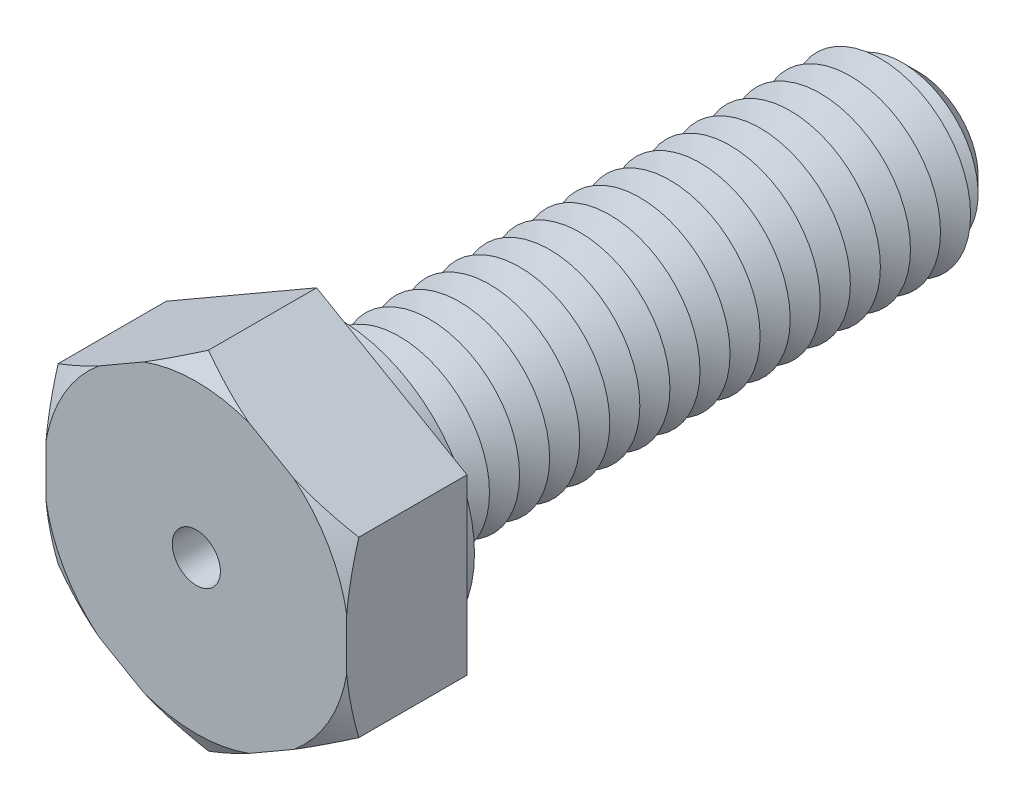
ISO-10303-21;
HEADER;
FILE_DESCRIPTION(('STEP AP214'),'2;1');
FILE_NAME('part.step','',(''),(''),'','','');
FILE_SCHEMA(('AUTOMOTIVE_DESIGN { 1 0 10303 214 1 1 1 1 }'));
ENDSEC;
DATA;
#1=APPLICATION_CONTEXT('core data for automotive mechanical design processes');
#2=APPLICATION_PROTOCOL_DEFINITION('international standard','automotive_design',2000,#1);
#3=PRODUCT_CONTEXT('',#1,'mechanical');
#4=PRODUCT('Part','Part','',(#3));
#5=PRODUCT_RELATED_PRODUCT_CATEGORY('part','',(#4));
#6=PRODUCT_DEFINITION_FORMATION('','',#4);
#7=PRODUCT_DEFINITION_CONTEXT('part definition',#1,'design');
#8=PRODUCT_DEFINITION('design','',#6,#7);
#9=PRODUCT_DEFINITION_SHAPE('','',#8);
#10=(LENGTH_UNIT() NAMED_UNIT(*) SI_UNIT(.MILLI.,.METRE.));
#11=(NAMED_UNIT(*) PLANE_ANGLE_UNIT() SI_UNIT($,.RADIAN.));
#12=(NAMED_UNIT(*) SI_UNIT($,.STERADIAN.) SOLID_ANGLE_UNIT());
#13=UNCERTAINTY_MEASURE_WITH_UNIT(LENGTH_MEASURE(1.E-05),#10,'distance_accuracy_value','');
#14=(GEOMETRIC_REPRESENTATION_CONTEXT(3) GLOBAL_UNCERTAINTY_ASSIGNED_CONTEXT((#13)) GLOBAL_UNIT_ASSIGNED_CONTEXT((#10,
#11,#12)) REPRESENTATION_CONTEXT('',''));
#15=CARTESIAN_POINT('',(0.,0.,0.));
#16=DIRECTION('',(0.,0.,1.));
#17=DIRECTION('',(1.,0.,0.));
#18=AXIS2_PLACEMENT_3D('',#15,#16,#17);
#19=CARTESIAN_POINT('',(5.,2.88675134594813,4.));
#20=DIRECTION('',(-0.5,-0.866025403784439,0.));
#21=DIRECTION('',(0.866025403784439,-0.5,0.));
#22=AXIS2_PLACEMENT_3D('',#19,#20,#21);
#23=PLANE('',#22);
#24=CARTESIAN_POINT('',(8.47277829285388,0.881741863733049,2.01100959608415));
#25=CARTESIAN_POINT('',(8.31567675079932,0.972444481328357,2.09578624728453));
#26=CARTESIAN_POINT('',(8.15819937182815,1.06336408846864,2.17964850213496));
#27=CARTESIAN_POINT('',(7.84233445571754,1.24572878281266,2.34511482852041));
#28=CARTESIAN_POINT('',(7.68394680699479,1.33717393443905,2.42671861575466));
#29=CARTESIAN_POINT('',(7.3656324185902,1.52095283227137,2.58747458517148));
#30=CARTESIAN_POINT('',(7.2057023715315,1.61328848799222,2.66661806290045));
#31=CARTESIAN_POINT('',(6.88464436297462,1.79865141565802,2.82158887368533));
#32=CARTESIAN_POINT('',(6.72351643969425,1.89167866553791,2.89741631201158));
#33=CARTESIAN_POINT('',(6.39574451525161,2.08091787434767,3.04691088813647));
#34=CARTESIAN_POINT('',(6.22906463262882,2.17715054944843,3.12047362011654));
#35=CARTESIAN_POINT('',(5.89404164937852,2.3705761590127,3.26235309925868));
#36=CARTESIAN_POINT('',(5.72569864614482,2.46776903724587,3.33067015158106));
#37=CARTESIAN_POINT('',(5.38728347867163,2.66315312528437,3.46077059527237));
#38=CARTESIAN_POINT('',(5.21721304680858,2.7613433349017,3.52255993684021));
#39=CARTESIAN_POINT('',(4.87507545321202,2.95887656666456,3.63817490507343));
#40=CARTESIAN_POINT('',(4.70300855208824,3.058219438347,3.69200155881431));
#41=CARTESIAN_POINT('',(4.29152467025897,3.29578976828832,3.8084273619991));
#42=CARTESIAN_POINT('',(4.05114917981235,3.43457062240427,3.86669526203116));
#43=CARTESIAN_POINT('',(3.68812002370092,3.64416560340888,3.93673911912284));
#44=CARTESIAN_POINT('',(3.56670137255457,3.71426669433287,3.95719387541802));
#45=CARTESIAN_POINT('',(3.32319777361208,3.85485356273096,3.99180309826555));
#46=CARTESIAN_POINT('',(3.20111291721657,3.92533928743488,4.0059584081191));
#47=CARTESIAN_POINT('',(2.95790980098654,4.06575267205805,4.0274398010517));
#48=CARTESIAN_POINT('',(2.83679666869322,4.13567737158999,4.03484289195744));
#49=CARTESIAN_POINT('',(2.59440145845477,4.27562431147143,4.04287861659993));
#50=CARTESIAN_POINT('',(2.47311938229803,4.34564655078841,4.0435113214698));
#51=CARTESIAN_POINT('',(2.23067249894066,4.48562332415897,4.03798617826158));
#52=CARTESIAN_POINT('',(2.10950769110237,4.55557785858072,4.03182836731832));
#53=CARTESIAN_POINT('',(1.86755304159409,4.695270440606,4.01290860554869));
#54=CARTESIAN_POINT('',(1.7467632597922,4.76500845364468,4.00014564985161));
#55=CARTESIAN_POINT('',(1.46148107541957,4.92971619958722,3.96252552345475));
#56=CARTESIAN_POINT('',(1.29725580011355,5.02453170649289,3.93494657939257));
#57=CARTESIAN_POINT('',(0.970375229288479,5.21325629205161,3.86938275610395));
#58=CARTESIAN_POINT('',(0.807720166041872,5.30716523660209,3.83139636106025));
#59=CARTESIAN_POINT('',(0.484000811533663,5.4940646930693,3.7464515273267));
#60=CARTESIAN_POINT('',(0.32293853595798,5.58705404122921,3.6994829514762));
#61=CARTESIAN_POINT('',(0.00262118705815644,5.77198934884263,3.59805355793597));
#62=CARTESIAN_POINT('',(-0.156634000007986,5.86393537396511,3.54359321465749));
#63=CARTESIAN_POINT('',(-0.475335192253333,6.04793759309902,3.42778810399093));
#64=CARTESIAN_POINT('',(-0.63476076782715,6.13998199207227,3.36636889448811));
#65=CARTESIAN_POINT('',(-0.951922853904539,6.3230956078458,3.2383676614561));
#66=CARTESIAN_POINT('',(-1.10966040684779,6.4141654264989,3.17178906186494));
#67=CARTESIAN_POINT('',(-1.42369760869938,6.59547488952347,3.03438397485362));
#68=CARTESIAN_POINT('',(-1.57999755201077,6.68571470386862,2.96355838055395));
#69=CARTESIAN_POINT('',(-1.89137153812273,6.86548655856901,2.81840247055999));
#70=CARTESIAN_POINT('',(-2.04644555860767,6.95501858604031,2.74407209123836));
#71=CARTESIAN_POINT('',(-2.30843737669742,7.1062796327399,2.61560341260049));
#72=CARTESIAN_POINT('',(-2.41563149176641,7.16816818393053,2.5622132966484));
#73=CARTESIAN_POINT('',(-2.62954890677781,7.29167346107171,2.45420118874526));
#74=CARTESIAN_POINT('',(-2.73627222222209,7.35329019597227,2.39957923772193));
#75=CARTESIAN_POINT('',(-2.94817046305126,7.4756297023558,2.28983212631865));
#76=CARTESIAN_POINT('',(-3.05334983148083,7.53635503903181,2.23471838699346));
#77=CARTESIAN_POINT('',(-3.26333506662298,7.65759007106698,2.12354428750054));
#78=CARTESIAN_POINT('',(-3.36814092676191,7.71809976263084,2.06748391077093));
#79=CARTESIAN_POINT('',(-3.47277829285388,7.77851217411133,2.01100959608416));
#80=B_SPLINE_CURVE_WITH_KNOTS('',3,(#24,#25,#26,#27,#28,#29,#30,#31,#32,#33,#34,#35,#36,#37,#38,
#39,#40,#41,#42,#43,#44,#45,#46,#47,#48,#49,#50,#51,#52,#53,#54,#55,#56,#57,#58,#59,#60,#61,#62,
#63,#64,#65,#66,#67,#68,#69,#70,#71,#72,#73,#74,#75,#76,#77,#78,#79),.UNSPECIFIED.,.F.,.F.,(4,2,
2,2,2,2,2,2,2,2,2,2,2,2,2,2,2,2,2,2,2,2,2,2,2,2,2,4),(0.,0.600718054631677,1.20151138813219,
1.80423204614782,2.40693355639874,3.02500509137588,3.64304064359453,4.26050788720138,
4.87789541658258,5.72780796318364,6.15275000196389,6.57763513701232,6.99761163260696,
7.41758371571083,7.83755350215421,8.25758719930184,8.83211758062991,9.40673168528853,
9.98199815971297,10.5572282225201,11.1393271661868,11.7210430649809,12.3026370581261,
12.8842416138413,13.2886376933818,13.6930203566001,14.0931288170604,14.493244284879),.UNSPECIFIED.);
#81=CARTESIAN_POINT('',(5.,2.88675134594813,3.59585481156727));
#82=VERTEX_POINT('',#81);
#83=CARTESIAN_POINT('',(3.24519941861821,3.89988593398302,4.));
#84=VERTEX_POINT('',#83);
#85=EDGE_CURVE('E132',#82,#84,#80,.T.);
#86=ORIENTED_EDGE('',*,*,#85,.F.);
#87=DIRECTION('',(0.,0.,-1.));
#88=VECTOR('',#87,1.);
#89=CARTESIAN_POINT('',(5.,2.88675134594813,4.));
#90=LINE('',#89,#88);
#91=CARTESIAN_POINT('',(5.,2.88675134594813,0.));
#92=VERTEX_POINT('',#91);
#93=EDGE_CURVE('E144',#82,#92,#90,.T.);
#94=ORIENTED_EDGE('',*,*,#93,.T.);
#95=DIRECTION('',(-0.866025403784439,0.5,0.));
#96=VECTOR('',#95,1.);
#97=CARTESIAN_POINT('',(5.,2.88675134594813,0.));
#98=LINE('',#97,#96);
#99=CARTESIAN_POINT('',(0.,5.77350269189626,0.));
#100=VERTEX_POINT('',#99);
#101=EDGE_CURVE('E353',#92,#100,#98,.T.);
#102=ORIENTED_EDGE('',*,*,#101,.T.);
#103=DIRECTION('',(0.,0.,-1.));
#104=VECTOR('',#103,1.);
#105=CARTESIAN_POINT('',(0.,5.77350269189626,4.));
#106=LINE('',#105,#104);
#107=CARTESIAN_POINT('',(0.,5.77350269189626,3.59585481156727));
#108=VERTEX_POINT('',#107);
#109=EDGE_CURVE('E179',#108,#100,#106,.T.);
#110=ORIENTED_EDGE('',*,*,#109,.F.);
#111=CARTESIAN_POINT('',(1.75480058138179,4.76036810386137,4.));
#112=VERTEX_POINT('',#111);
#113=EDGE_CURVE('E151',#112,#108,#80,.T.);
#114=ORIENTED_EDGE('',*,*,#113,.F.);
#115=DIRECTION('',(-0.866025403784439,0.5,0.));
#116=VECTOR('',#115,1.);
#117=CARTESIAN_POINT('',(5.,2.88675134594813,4.));
#118=LINE('',#117,#116);
#119=EDGE_CURVE('E148',#84,#112,#118,.T.);
#120=ORIENTED_EDGE('',*,*,#119,.F.);
#121=EDGE_LOOP('',(#86,#94,#102,#110,#114,#120));
#122=FACE_BOUND('',#121,.T.);
#123=ADVANCED_FACE('F39',(#122),#23,.F.);
#124=CARTESIAN_POINT('',(0.,5.77350269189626,4.));
#125=DIRECTION('',(0.5,-0.866025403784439,0.));
#126=DIRECTION('',(0.866025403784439,0.5,0.));
#127=AXIS2_PLACEMENT_3D('',#124,#125,#126);
#128=PLANE('',#127);
#129=CARTESIAN_POINT('',(3.47277829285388,7.77851217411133,2.01100959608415));
#130=CARTESIAN_POINT('',(3.31567675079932,7.68780955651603,2.09578624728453));
#131=CARTESIAN_POINT('',(3.15819937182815,7.59688994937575,2.17964850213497));
#132=CARTESIAN_POINT('',(2.84233445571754,7.41452525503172,2.34511482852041));
#133=CARTESIAN_POINT('',(2.68394680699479,7.32308010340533,2.42671861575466));
#134=CARTESIAN_POINT('',(2.36563241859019,7.13930120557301,2.58747458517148));
#135=CARTESIAN_POINT('',(2.2057023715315,7.04696554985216,2.66661806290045));
#136=CARTESIAN_POINT('',(1.88464436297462,6.86160262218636,2.82158887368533));
#137=CARTESIAN_POINT('',(1.72351643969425,6.76857537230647,2.89741631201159));
#138=CARTESIAN_POINT('',(1.39574451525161,6.57933616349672,3.04691088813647));
#139=CARTESIAN_POINT('',(1.22906463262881,6.48310348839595,3.12047362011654));
#140=CARTESIAN_POINT('',(0.894041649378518,6.28967787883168,3.26235309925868));
#141=CARTESIAN_POINT('',(0.725698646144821,6.19248500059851,3.33067015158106));
#142=CARTESIAN_POINT('',(0.38728347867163,5.99710091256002,3.46077059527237));
#143=CARTESIAN_POINT('',(0.217213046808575,5.89891070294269,3.52255993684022));
#144=CARTESIAN_POINT('',(-0.124924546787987,5.70137747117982,3.63817490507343));
#145=CARTESIAN_POINT('',(-0.296991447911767,5.60203459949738,3.69200155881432));
#146=CARTESIAN_POINT('',(-0.708475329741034,5.36446426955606,3.8084273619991));
#147=CARTESIAN_POINT('',(-0.948850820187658,5.22568341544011,3.86669526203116));
#148=CARTESIAN_POINT('',(-1.31187997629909,5.0160884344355,3.93673911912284));
#149=CARTESIAN_POINT('',(-1.43329862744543,4.94598734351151,3.95719387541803));
#150=CARTESIAN_POINT('',(-1.67680222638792,4.80540047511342,3.99180309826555));
#151=CARTESIAN_POINT('',(-1.79888708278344,4.7349147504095,4.0059584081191));
#152=CARTESIAN_POINT('',(-2.04209019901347,4.59450136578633,4.0274398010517));
#153=CARTESIAN_POINT('',(-2.16320333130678,4.52457666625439,4.03484289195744));
#154=CARTESIAN_POINT('',(-2.40559854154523,4.38462972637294,4.04287861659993));
#155=CARTESIAN_POINT('',(-2.52688061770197,4.31460748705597,4.04351132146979));
#156=CARTESIAN_POINT('',(-2.76932750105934,4.17463071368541,4.03798617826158));
#157=CARTESIAN_POINT('',(-2.89049230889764,4.10467617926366,4.03182836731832));
#158=CARTESIAN_POINT('',(-3.13244695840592,3.96498359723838,4.01290860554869));
#159=CARTESIAN_POINT('',(-3.25323674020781,3.8952455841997,4.00014564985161));
#160=CARTESIAN_POINT('',(-3.53851892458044,3.73053783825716,3.96252552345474));
#161=CARTESIAN_POINT('',(-3.70274419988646,3.63572233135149,3.93494657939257));
#162=CARTESIAN_POINT('',(-4.02962477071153,3.44699774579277,3.86938275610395));
#163=CARTESIAN_POINT('',(-4.19227983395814,3.35308880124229,3.83139636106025));
#164=CARTESIAN_POINT('',(-4.51599918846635,3.16618934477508,3.7464515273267));
#165=CARTESIAN_POINT('',(-4.67706146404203,3.07319999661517,3.6994829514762));
#166=CARTESIAN_POINT('',(-4.99737881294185,2.88826468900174,3.59805355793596));
#167=CARTESIAN_POINT('',(-5.156634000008,2.79631866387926,3.54359321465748));
#168=CARTESIAN_POINT('',(-5.47533519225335,2.61231644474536,3.42778810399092));
#169=CARTESIAN_POINT('',(-5.63476076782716,2.5202720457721,3.3663688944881));
#170=CARTESIAN_POINT('',(-5.95192285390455,2.33715842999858,3.23836766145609));
#171=CARTESIAN_POINT('',(-6.10966040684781,2.24608861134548,3.17178906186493));
#172=CARTESIAN_POINT('',(-6.4236976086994,2.0647791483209,3.03438397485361));
#173=CARTESIAN_POINT('',(-6.57999755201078,1.97453933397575,2.96355838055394));
#174=CARTESIAN_POINT('',(-6.89137153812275,1.79476747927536,2.81840247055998));
#175=CARTESIAN_POINT('',(-7.04644555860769,1.70523545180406,2.74407209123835));
#176=CARTESIAN_POINT('',(-7.30843737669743,1.55397440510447,2.61560341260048));
#177=CARTESIAN_POINT('',(-7.41563149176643,1.49208585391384,2.56221329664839));
#178=CARTESIAN_POINT('',(-7.62954890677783,1.36858057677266,2.45420118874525));
#179=CARTESIAN_POINT('',(-7.7362722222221,1.30696384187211,2.39957923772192));
#180=CARTESIAN_POINT('',(-7.94817046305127,1.18462433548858,2.28983212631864));
#181=CARTESIAN_POINT('',(-8.05334983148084,1.12389899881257,2.23471838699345));
#182=CARTESIAN_POINT('',(-8.26333506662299,1.0026639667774,2.12354428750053));
#183=CARTESIAN_POINT('',(-8.36814092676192,0.94215427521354,2.06748391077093));
#184=CARTESIAN_POINT('',(-8.47277829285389,0.881741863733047,2.01100959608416));
#185=B_SPLINE_CURVE_WITH_KNOTS('',3,(#129,#130,#131,#132,#133,#134,#135,#136,#137,#138,#139,
#140,#141,#142,#143,#144,#145,#146,#147,#148,#149,#150,#151,#152,#153,#154,#155,#156,#157,#158,
#159,#160,#161,#162,#163,#164,#165,#166,#167,#168,#169,#170,#171,#172,#173,#174,#175,#176,#177,
#178,#179,#180,#181,#182,#183,#184),.UNSPECIFIED.,.F.,.F.,(4,2,2,2,2,2,2,2,2,2,2,2,2,2,2,2,2,2,
2,2,2,2,2,2,2,2,2,4),(0.,0.600718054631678,1.20151138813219,1.80423204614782,2.40693355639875,
3.02500509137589,3.64304064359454,4.26050788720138,4.87789541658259,5.72780796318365,
6.1527500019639,6.57763513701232,6.99761163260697,7.41758371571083,7.83755350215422,
8.25758719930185,8.83211758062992,9.40673168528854,9.98199815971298,10.5572282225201,
11.1393271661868,11.7210430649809,12.3026370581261,12.8842416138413,13.2886376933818,
13.6930203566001,14.0931288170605,14.493244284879),.UNSPECIFIED.);
#186=CARTESIAN_POINT('',(-1.75480058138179,4.76036810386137,4.));
#187=VERTEX_POINT('',#186);
#188=EDGE_CURVE('E1061',#108,#187,#185,.T.);
#189=ORIENTED_EDGE('',*,*,#188,.F.);
#190=ORIENTED_EDGE('',*,*,#109,.T.);
#191=DIRECTION('',(-0.866025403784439,-0.5,0.));
#192=VECTOR('',#191,1.);
#193=CARTESIAN_POINT('',(0.,5.77350269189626,0.));
#194=LINE('',#193,#192);
#195=CARTESIAN_POINT('',(-5.,2.88675134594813,0.));
#196=VERTEX_POINT('',#195);
#197=EDGE_CURVE('E372',#100,#196,#194,.T.);
#198=ORIENTED_EDGE('',*,*,#197,.T.);
#199=DIRECTION('',(0.,0.,-1.));
#200=VECTOR('',#199,1.);
#201=CARTESIAN_POINT('',(-5.,2.88675134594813,4.));
#202=LINE('',#201,#200);
#203=CARTESIAN_POINT('',(-5.,2.88675134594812,3.59585481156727));
#204=VERTEX_POINT('',#203);
#205=EDGE_CURVE('E176',#204,#196,#202,.T.);
#206=ORIENTED_EDGE('',*,*,#205,.F.);
#207=CARTESIAN_POINT('',(-3.24519941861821,3.89988593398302,4.));
#208=VERTEX_POINT('',#207);
#209=EDGE_CURVE('E445',#208,#204,#185,.T.);
#210=ORIENTED_EDGE('',*,*,#209,.F.);
#211=DIRECTION('',(-0.866025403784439,-0.5,0.));
#212=VECTOR('',#211,1.);
#213=CARTESIAN_POINT('',(0.,5.77350269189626,4.));
#214=LINE('',#213,#212);
#215=EDGE_CURVE('E356',#187,#208,#214,.T.);
#216=ORIENTED_EDGE('',*,*,#215,.F.);
#217=EDGE_LOOP('',(#189,#190,#198,#206,#210,#216));
#218=FACE_BOUND('',#217,.T.);
#219=ADVANCED_FACE('F454',(#218),#128,.F.);
#220=CARTESIAN_POINT('',(-5.,2.88675134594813,4.));
#221=DIRECTION('',(1.,0.,0.));
#222=DIRECTION('',(0.,0.,-1.));
#223=AXIS2_PLACEMENT_3D('',#220,#221,#222);
#224=PLANE('',#223);
#225=CARTESIAN_POINT('',(-5.,6.35952963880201,2.25858442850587));
#226=CARTESIAN_POINT('',(-5.,6.17888675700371,2.34055079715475));
#227=CARTESIAN_POINT('',(-5.,5.99774985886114,2.42144915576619));
#228=CARTESIAN_POINT('',(-5.,5.63427640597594,2.58059164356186));
#229=CARTESIAN_POINT('',(-5.,5.45193964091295,2.65883529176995));
#230=CARTESIAN_POINT('',(-5.,5.08515575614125,2.81244019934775));
#231=CARTESIAN_POINT('',(-5.,4.90070300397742,2.8877880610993));
#232=CARTESIAN_POINT('',(-5.,4.53023851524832,3.0345384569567));
#233=CARTESIAN_POINT('',(-5.,4.34422685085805,3.10594117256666));
#234=CARTESIAN_POINT('',(-5.,3.9712497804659,3.24361472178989));
#235=CARTESIAN_POINT('',(-5.,3.78429235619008,3.30990707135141));
#236=CARTESIAN_POINT('',(-5.,3.40837814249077,3.43663614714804));
#237=CARTESIAN_POINT('',(-5.,3.21942124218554,3.49707254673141));
#238=CARTESIAN_POINT('',(-5.,2.83960832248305,3.61070280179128));
#239=CARTESIAN_POINT('',(-5.,2.64875526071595,3.66390646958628));
#240=CARTESIAN_POINT('',(-5.,2.26482213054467,3.76165698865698));
#241=CARTESIAN_POINT('',(-5.,2.07174215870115,3.80620421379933));
#242=CARTESIAN_POINT('',(-5.,1.7384332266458,3.87385543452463));
#243=CARTESIAN_POINT('',(-5.,1.59871159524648,3.89946008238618));
#244=CARTESIAN_POINT('',(-5.,1.31833206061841,3.94478995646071));
#245=CARTESIAN_POINT('',(-5.,1.17767431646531,3.96451615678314));
#246=CARTESIAN_POINT('',(-5.,0.895629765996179,3.99757345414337));
#247=CARTESIAN_POINT('',(-5.,0.754243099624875,4.01090573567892));
#248=CARTESIAN_POINT('',(-5.,0.470989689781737,4.03079351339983));
#249=CARTESIAN_POINT('',(-5.,0.329122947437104,4.03734902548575));
#250=CARTESIAN_POINT('',(-5.,0.0453101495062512,4.04347876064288));
#251=CARTESIAN_POINT('',(-5.,-0.0966358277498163,4.04305657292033));
#252=CARTESIAN_POINT('',(-5.,-0.380333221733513,4.03525341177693));
#253=CARTESIAN_POINT('',(-5.,-0.522084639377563,4.02787247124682));
#254=CARTESIAN_POINT('',(-5.,-0.805078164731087,4.00637695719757));
#255=CARTESIAN_POINT('',(-5.,-0.946320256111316,3.99226216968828));
#256=CARTESIAN_POINT('',(-5.,-1.22803871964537,3.95770663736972));
#257=CARTESIAN_POINT('',(-5.,-1.36851494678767,3.93726473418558));
#258=CARTESIAN_POINT('',(-5.,-1.92842653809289,3.84388033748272));
#259=CARTESIAN_POINT('',(-5.,-2.34409397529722,3.74768165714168));
#260=CARTESIAN_POINT('',(-5.,-2.95991397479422,3.57615402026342));
#261=CARTESIAN_POINT('',(-5.,-3.16417440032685,3.51433916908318));
#262=CARTESIAN_POINT('',(-5.,-3.57033913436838,3.3833457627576));
#263=CARTESIAN_POINT('',(-5.,-3.77224360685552,3.31416772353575));
#264=CARTESIAN_POINT('',(-5.,-4.17620397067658,3.16907432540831));
#265=CARTESIAN_POINT('',(-5.,-4.37823505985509,3.09309081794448));
#266=CARTESIAN_POINT('',(-5.,-4.78041106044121,2.93626257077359));
#267=CARTESIAN_POINT('',(-5.,-4.98055585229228,2.85541752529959));
#268=CARTESIAN_POINT('',(-5.,-5.37797431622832,2.69033488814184));
#269=CARTESIAN_POINT('',(-5.,-5.57525810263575,2.60612151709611));
#270=CARTESIAN_POINT('',(-5.,-5.96839598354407,2.43454627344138));
#271=CARTESIAN_POINT('',(-5.,-6.16425041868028,2.34718518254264));
#272=CARTESIAN_POINT('',(-5.,-6.35952963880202,2.25858442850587));
#273=B_SPLINE_CURVE_WITH_KNOTS('',3,(#225,#226,#227,#228,#229,#230,#231,#232,#233,#234,#235,
#236,#237,#238,#239,#240,#241,#242,#243,#244,#245,#246,#247,#248,#249,#250,#251,#252,#253,#254,
#255,#256,#257,#258,#259,#260,#261,#262,#263,#264,#265,#266,#267,#268,#269,#270,#271,#272),
.UNSPECIFIED.,.F.,.F.,(4,2,2,2,2,2,2,2,2,2,2,2,2,2,2,2,2,2,2,2,2,2,2,4),(0.,0.595116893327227,
1.19034103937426,1.78805021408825,2.3857318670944,2.98074146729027,3.57578423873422,
4.17001151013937,4.7642131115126,5.19024951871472,5.61621528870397,6.0421021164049,
6.46798794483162,6.89365471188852,7.3193194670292,7.74499774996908,8.17075401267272,
9.44769357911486,10.0878733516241,10.7280082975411,11.3754821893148,12.0229968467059,
12.6664852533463,13.3098149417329),.UNSPECIFIED.);
#274=CARTESIAN_POINT('',(-5.,0.86048216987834,4.));
#275=VERTEX_POINT('',#274);
#276=EDGE_CURVE('E443',#204,#275,#273,.T.);
#277=ORIENTED_EDGE('',*,*,#276,.F.);
#278=ORIENTED_EDGE('',*,*,#205,.T.);
#279=DIRECTION('',(0.,-1.,0.));
#280=VECTOR('',#279,1.);
#281=CARTESIAN_POINT('',(-5.,2.88675134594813,0.));
#282=LINE('',#281,#280);
#283=CARTESIAN_POINT('',(-5.,-2.88675134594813,0.));
#284=VERTEX_POINT('',#283);
#285=EDGE_CURVE('E376',#196,#284,#282,.T.);
#286=ORIENTED_EDGE('',*,*,#285,.T.);
#287=DIRECTION('',(0.,0.,-1.));
#288=VECTOR('',#287,1.);
#289=CARTESIAN_POINT('',(-5.,-2.88675134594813,4.));
#290=LINE('',#289,#288);
#291=CARTESIAN_POINT('',(-4.99999999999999,-2.88675134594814,3.59585481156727));
#292=VERTEX_POINT('',#291);
#293=EDGE_CURVE('E173',#292,#284,#290,.T.);
#294=ORIENTED_EDGE('',*,*,#293,.F.);
#295=CARTESIAN_POINT('',(-5.,-0.86048216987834,4.));
#296=VERTEX_POINT('',#295);
#297=EDGE_CURVE('E437',#296,#292,#273,.T.);
#298=ORIENTED_EDGE('',*,*,#297,.F.);
#299=DIRECTION('',(0.,-1.,0.));
#300=VECTOR('',#299,1.);
#301=CARTESIAN_POINT('',(-5.,2.88675134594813,4.));
#302=LINE('',#301,#300);
#303=EDGE_CURVE('E359',#275,#296,#302,.T.);
#304=ORIENTED_EDGE('',*,*,#303,.F.);
#305=EDGE_LOOP('',(#277,#278,#286,#294,#298,#304));
#306=FACE_BOUND('',#305,.T.);
#307=ADVANCED_FACE('F450',(#306),#224,.F.);
#308=CARTESIAN_POINT('',(-5.,-2.88675134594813,4.));
#309=DIRECTION('',(0.5,0.866025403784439,0.));
#310=DIRECTION('',(-0.866025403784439,0.5,0.));
#311=AXIS2_PLACEMENT_3D('',#308,#309,#310);
#312=PLANE('',#311);
#313=CARTESIAN_POINT('',(-8.47277829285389,-0.881741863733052,2.01100959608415));
#314=CARTESIAN_POINT('',(-8.31567675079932,-0.972444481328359,2.09578624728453));
#315=CARTESIAN_POINT('',(-8.15819937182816,-1.06336408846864,2.17964850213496));
#316=CARTESIAN_POINT('',(-7.84233445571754,-1.24572878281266,2.34511482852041));
#317=CARTESIAN_POINT('',(-7.68394680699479,-1.33717393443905,2.42671861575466));
#318=CARTESIAN_POINT('',(-7.3656324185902,-1.52095283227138,2.58747458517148));
#319=CARTESIAN_POINT('',(-7.2057023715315,-1.61328848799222,2.66661806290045));
#320=CARTESIAN_POINT('',(-6.88464436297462,-1.79865141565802,2.82158887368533));
#321=CARTESIAN_POINT('',(-6.72351643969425,-1.89167866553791,2.89741631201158));
#322=CARTESIAN_POINT('',(-6.39574451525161,-2.08091787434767,3.04691088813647));
#323=CARTESIAN_POINT('',(-6.22906463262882,-2.17715054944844,3.12047362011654));
#324=CARTESIAN_POINT('',(-5.89404164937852,-2.37057615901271,3.26235309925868));
#325=CARTESIAN_POINT('',(-5.72569864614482,-2.46776903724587,3.33067015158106));
#326=CARTESIAN_POINT('',(-5.38728347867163,-2.66315312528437,3.46077059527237));
#327=CARTESIAN_POINT('',(-5.21721304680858,-2.7613433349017,3.52255993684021));
#328=CARTESIAN_POINT('',(-4.87507545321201,-2.95887656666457,3.63817490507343));
#329=CARTESIAN_POINT('',(-4.70300855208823,-3.05821943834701,3.69200155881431));
#330=CARTESIAN_POINT('',(-4.29152467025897,-3.29578976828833,3.8084273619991));
#331=CARTESIAN_POINT('',(-4.05114917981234,-3.43457062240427,3.86669526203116));
#332=CARTESIAN_POINT('',(-3.68812002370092,-3.64416560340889,3.93673911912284));
#333=CARTESIAN_POINT('',(-3.56670137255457,-3.71426669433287,3.95719387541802));
#334=CARTESIAN_POINT('',(-3.32319777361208,-3.85485356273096,3.99180309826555));
#335=CARTESIAN_POINT('',(-3.20111291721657,-3.92533928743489,4.0059584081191));
#336=CARTESIAN_POINT('',(-2.95790980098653,-4.06575267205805,4.0274398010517));
#337=CARTESIAN_POINT('',(-2.83679666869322,-4.13567737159,4.03484289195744));
#338=CARTESIAN_POINT('',(-2.59440145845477,-4.27562431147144,4.04287861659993));
#339=CARTESIAN_POINT('',(-2.47311938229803,-4.34564655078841,4.04351132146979));
#340=CARTESIAN_POINT('',(-2.23067249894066,-4.48562332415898,4.03798617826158));
#341=CARTESIAN_POINT('',(-2.10950769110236,-4.55557785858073,4.03182836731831));
#342=CARTESIAN_POINT('',(-1.86755304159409,-4.69527044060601,4.01290860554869));
#343=CARTESIAN_POINT('',(-1.74676325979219,-4.76500845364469,4.00014564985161));
#344=CARTESIAN_POINT('',(-1.46148107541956,-4.92971619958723,3.96252552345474));
#345=CARTESIAN_POINT('',(-1.29725580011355,-5.0245317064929,3.93494657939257));
#346=CARTESIAN_POINT('',(-0.970375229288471,-5.21325629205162,3.86938275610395));
#347=CARTESIAN_POINT('',(-0.807720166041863,-5.3071652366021,3.83139636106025));
#348=CARTESIAN_POINT('',(-0.484000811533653,-5.49406469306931,3.7464515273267));
#349=CARTESIAN_POINT('',(-0.322938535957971,-5.58705404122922,3.6994829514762));
#350=CARTESIAN_POINT('',(-0.00262118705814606,-5.77198934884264,3.59805355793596));
#351=CARTESIAN_POINT('',(0.156634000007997,-5.86393537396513,3.54359321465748));
#352=CARTESIAN_POINT('',(0.475335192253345,-6.04793759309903,3.42778810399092));
#353=CARTESIAN_POINT('',(0.634760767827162,-6.13998199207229,3.3663688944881));
#354=CARTESIAN_POINT('',(0.951922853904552,-6.32309560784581,3.23836766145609));
#355=CARTESIAN_POINT('',(1.10966040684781,-6.41416542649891,3.17178906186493));
#356=CARTESIAN_POINT('',(1.4236976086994,-6.59547488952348,3.03438397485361));
#357=CARTESIAN_POINT('',(1.57999755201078,-6.68571470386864,2.96355838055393));
#358=CARTESIAN_POINT('',(1.89137153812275,-6.86548655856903,2.81840247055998));
#359=CARTESIAN_POINT('',(2.04644555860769,-6.95501858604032,2.74407209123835));
#360=CARTESIAN_POINT('',(2.30843737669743,-7.10627963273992,2.61560341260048));
#361=CARTESIAN_POINT('',(2.41563149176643,-7.16816818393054,2.56221329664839));
#362=CARTESIAN_POINT('',(2.62954890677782,-7.29167346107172,2.45420118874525));
#363=CARTESIAN_POINT('',(2.73627222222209,-7.35329019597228,2.39957923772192));
#364=CARTESIAN_POINT('',(2.94817046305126,-7.47562970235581,2.28983212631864));
#365=CARTESIAN_POINT('',(3.05334983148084,-7.53635503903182,2.23471838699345));
#366=CARTESIAN_POINT('',(3.26333506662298,-7.65759007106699,2.12354428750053));
#367=CARTESIAN_POINT('',(3.36814092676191,-7.71809976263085,2.06748391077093));
#368=CARTESIAN_POINT('',(3.47277829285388,-7.77851217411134,2.01100959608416));
#369=B_SPLINE_CURVE_WITH_KNOTS('',3,(#313,#314,#315,#316,#317,#318,#319,#320,#321,#322,#323,
#324,#325,#326,#327,#328,#329,#330,#331,#332,#333,#334,#335,#336,#337,#338,#339,#340,#341,#342,
#343,#344,#345,#346,#347,#348,#349,#350,#351,#352,#353,#354,#355,#356,#357,#358,#359,#360,#361,
#362,#363,#364,#365,#366,#367,#368),.UNSPECIFIED.,.F.,.F.,(4,2,2,2,2,2,2,2,2,2,2,2,2,2,2,2,2,2,
2,2,2,2,2,2,2,2,2,4),(0.,0.600718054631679,1.20151138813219,1.80423204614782,2.40693355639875,
3.02500509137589,3.64304064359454,4.26050788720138,4.87789541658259,5.72780796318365,
6.1527500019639,6.57763513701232,6.99761163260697,7.41758371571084,7.83755350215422,
8.25758719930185,8.83211758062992,9.40673168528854,9.98199815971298,10.5572282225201,
11.1393271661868,11.7210430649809,12.3026370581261,12.8842416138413,13.2886376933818,
13.6930203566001,14.0931288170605,14.493244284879),.UNSPECIFIED.);
#370=CARTESIAN_POINT('',(-3.24519941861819,-3.89988593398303,4.));
#371=VERTEX_POINT('',#370);
#372=EDGE_CURVE('E444',#292,#371,#369,.T.);
#373=ORIENTED_EDGE('',*,*,#372,.F.);
#374=ORIENTED_EDGE('',*,*,#293,.T.);
#375=DIRECTION('',(0.866025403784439,-0.5,0.));
#376=VECTOR('',#375,1.);
#377=CARTESIAN_POINT('',(-5.,-2.88675134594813,0.));
#378=LINE('',#377,#376);
#379=CARTESIAN_POINT('',(0.,-5.77350269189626,0.));
#380=VERTEX_POINT('',#379);
#381=EDGE_CURVE('E380',#284,#380,#378,.T.);
#382=ORIENTED_EDGE('',*,*,#381,.T.);
#383=DIRECTION('',(0.,0.,-1.));
#384=VECTOR('',#383,1.);
#385=CARTESIAN_POINT('',(0.,-5.77350269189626,4.));
#386=LINE('',#385,#384);
#387=CARTESIAN_POINT('',(0.,-5.77350269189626,3.59585481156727));
#388=VERTEX_POINT('',#387);
#389=EDGE_CURVE('E163',#388,#380,#386,.T.);
#390=ORIENTED_EDGE('',*,*,#389,.F.);
#391=CARTESIAN_POINT('',(-1.75480058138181,-4.76036810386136,4.));
#392=VERTEX_POINT('',#391);
#393=EDGE_CURVE('E399',#392,#388,#369,.T.);
#394=ORIENTED_EDGE('',*,*,#393,.F.);
#395=DIRECTION('',(0.866025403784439,-0.5,0.));
#396=VECTOR('',#395,1.);
#397=CARTESIAN_POINT('',(-5.,-2.88675134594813,4.));
#398=LINE('',#397,#396);
#399=EDGE_CURVE('E363',#371,#392,#398,.T.);
#400=ORIENTED_EDGE('',*,*,#399,.F.);
#401=EDGE_LOOP('',(#373,#374,#382,#390,#394,#400));
#402=FACE_BOUND('',#401,.T.);
#403=ADVANCED_FACE('F453',(#402),#312,.F.);
#404=CARTESIAN_POINT('',(0.,-5.77350269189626,4.));
#405=DIRECTION('',(-0.5,0.866025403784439,0.));
#406=DIRECTION('',(-0.866025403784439,-0.5,0.));
#407=AXIS2_PLACEMENT_3D('',#404,#405,#406);
#408=PLANE('',#407);
#409=CARTESIAN_POINT('',(-3.47277829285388,-7.77851217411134,2.01100959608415));
#410=CARTESIAN_POINT('',(-3.31567675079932,-7.68780955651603,2.09578624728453));
#411=CARTESIAN_POINT('',(-3.15819937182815,-7.59688994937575,2.17964850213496));
#412=CARTESIAN_POINT('',(-2.84233445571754,-7.41452525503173,2.34511482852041));
#413=CARTESIAN_POINT('',(-2.68394680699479,-7.32308010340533,2.42671861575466));
#414=CARTESIAN_POINT('',(-2.36563241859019,-7.13930120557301,2.58747458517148));
#415=CARTESIAN_POINT('',(-2.2057023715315,-7.04696554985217,2.66661806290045));
#416=CARTESIAN_POINT('',(-1.88464436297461,-6.86160262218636,2.82158887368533));
#417=CARTESIAN_POINT('',(-1.72351643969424,-6.76857537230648,2.89741631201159));
#418=CARTESIAN_POINT('',(-1.39574451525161,-6.57933616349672,3.04691088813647));
#419=CARTESIAN_POINT('',(-1.22906463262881,-6.48310348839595,3.12047362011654));
#420=CARTESIAN_POINT('',(-0.894041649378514,-6.28967787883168,3.26235309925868));
#421=CARTESIAN_POINT('',(-0.725698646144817,-6.19248500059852,3.33067015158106));
#422=CARTESIAN_POINT('',(-0.387283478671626,-5.99710091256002,3.46077059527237));
#423=CARTESIAN_POINT('',(-0.217213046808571,-5.89891070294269,3.52255993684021));
#424=CARTESIAN_POINT('',(0.124924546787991,-5.70137747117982,3.63817490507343));
#425=CARTESIAN_POINT('',(0.296991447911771,-5.60203459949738,3.69200155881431));
#426=CARTESIAN_POINT('',(0.708475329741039,-5.36446426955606,3.8084273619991));
#427=CARTESIAN_POINT('',(0.948850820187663,-5.22568341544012,3.86669526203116));
#428=CARTESIAN_POINT('',(1.31187997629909,-5.0160884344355,3.93673911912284));
#429=CARTESIAN_POINT('',(1.43329862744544,-4.94598734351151,3.95719387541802));
#430=CARTESIAN_POINT('',(1.67680222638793,-4.80540047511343,3.99180309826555));
#431=CARTESIAN_POINT('',(1.79888708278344,-4.7349147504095,4.0059584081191));
#432=CARTESIAN_POINT('',(2.04209019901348,-4.59450136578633,4.0274398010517));
#433=CARTESIAN_POINT('',(2.16320333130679,-4.52457666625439,4.03484289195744));
#434=CARTESIAN_POINT('',(2.40559854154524,-4.38462972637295,4.04287861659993));
#435=CARTESIAN_POINT('',(2.52688061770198,-4.31460748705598,4.04351132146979));
#436=CARTESIAN_POINT('',(2.76932750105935,-4.17463071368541,4.03798617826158));
#437=CARTESIAN_POINT('',(2.89049230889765,-4.10467617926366,4.03182836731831));
#438=CARTESIAN_POINT('',(3.13244695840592,-3.96498359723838,4.01290860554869));
#439=CARTESIAN_POINT('',(3.25323674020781,-3.8952455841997,4.00014564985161));
#440=CARTESIAN_POINT('',(3.53851892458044,-3.73053783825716,3.96252552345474));
#441=CARTESIAN_POINT('',(3.70274419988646,-3.63572233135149,3.93494657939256));
#442=CARTESIAN_POINT('',(4.02962477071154,-3.44699774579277,3.86938275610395));
#443=CARTESIAN_POINT('',(4.19227983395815,-3.35308880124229,3.83139636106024));
#444=CARTESIAN_POINT('',(4.51599918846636,-3.16618934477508,3.7464515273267));
#445=CARTESIAN_POINT('',(4.67706146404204,-3.07319999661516,3.69948295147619));
#446=CARTESIAN_POINT('',(4.99737881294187,-2.88826468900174,3.59805355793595));
#447=CARTESIAN_POINT('',(5.15663400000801,-2.79631866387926,3.54359321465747));
#448=CARTESIAN_POINT('',(5.47533519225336,-2.61231644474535,3.42778810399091));
#449=CARTESIAN_POINT('',(5.63476076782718,-2.5202720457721,3.3663688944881));
#450=CARTESIAN_POINT('',(5.95192285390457,-2.33715842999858,3.23836766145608));
#451=CARTESIAN_POINT('',(6.10966040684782,-2.24608861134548,3.17178906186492));
#452=CARTESIAN_POINT('',(6.42369760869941,-2.0647791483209,3.0343839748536));
#453=CARTESIAN_POINT('',(6.5799975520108,-1.97453933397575,2.96355838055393));
#454=CARTESIAN_POINT('',(6.89137153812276,-1.79476747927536,2.81840247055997));
#455=CARTESIAN_POINT('',(7.04644555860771,-1.70523545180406,2.74407209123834));
#456=CARTESIAN_POINT('',(7.30843737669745,-1.55397440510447,2.61560341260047));
#457=CARTESIAN_POINT('',(7.41563149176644,-1.49208585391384,2.56221329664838));
#458=CARTESIAN_POINT('',(7.62954890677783,-1.36858057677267,2.45420118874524));
#459=CARTESIAN_POINT('',(7.7362722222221,-1.30696384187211,2.39957923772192));
#460=CARTESIAN_POINT('',(7.94817046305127,-1.18462433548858,2.28983212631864));
#461=CARTESIAN_POINT('',(8.05334983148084,-1.12389899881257,2.23471838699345));
#462=CARTESIAN_POINT('',(8.26333506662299,-1.00266396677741,2.12354428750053));
#463=CARTESIAN_POINT('',(8.36814092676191,-0.942154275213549,2.06748391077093));
#464=CARTESIAN_POINT('',(8.47277829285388,-0.881741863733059,2.01100959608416));
#465=B_SPLINE_CURVE_WITH_KNOTS('',3,(#409,#410,#411,#412,#413,#414,#415,#416,#417,#418,#419,
#420,#421,#422,#423,#424,#425,#426,#427,#428,#429,#430,#431,#432,#433,#434,#435,#436,#437,#438,
#439,#440,#441,#442,#443,#444,#445,#446,#447,#448,#449,#450,#451,#452,#453,#454,#455,#456,#457,
#458,#459,#460,#461,#462,#463,#464),.UNSPECIFIED.,.F.,.F.,(4,2,2,2,2,2,2,2,2,2,2,2,2,2,2,2,2,2,
2,2,2,2,2,2,2,2,2,4),(0.,0.600718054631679,1.20151138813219,1.80423204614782,2.40693355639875,
3.02500509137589,3.64304064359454,4.26050788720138,4.87789541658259,5.72780796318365,
6.1527500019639,6.57763513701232,6.99761163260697,7.41758371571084,7.83755350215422,
8.25758719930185,8.83211758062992,9.40673168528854,9.98199815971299,10.5572282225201,
11.1393271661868,11.7210430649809,12.3026370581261,12.8842416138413,13.2886376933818,
13.6930203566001,14.0931288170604,14.493244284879),.UNSPECIFIED.);
#466=CARTESIAN_POINT('',(1.75480058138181,-4.76036810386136,4.));
#467=VERTEX_POINT('',#466);
#468=EDGE_CURVE('E64',#388,#467,#465,.T.);
#469=ORIENTED_EDGE('',*,*,#468,.F.);
#470=ORIENTED_EDGE('',*,*,#389,.T.);
#471=DIRECTION('',(0.866025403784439,0.5,0.));
#472=VECTOR('',#471,1.);
#473=CARTESIAN_POINT('',(0.,-5.77350269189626,0.));
#474=LINE('',#473,#472);
#475=CARTESIAN_POINT('',(5.,-2.88675134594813,0.));
#476=VERTEX_POINT('',#475);
#477=EDGE_CURVE('E383',#380,#476,#474,.T.);
#478=ORIENTED_EDGE('',*,*,#477,.T.);
#479=DIRECTION('',(0.,0.,-1.));
#480=VECTOR('',#479,1.);
#481=CARTESIAN_POINT('',(5.,-2.88675134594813,4.));
#482=LINE('',#481,#480);
#483=CARTESIAN_POINT('',(5.,-2.88675134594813,3.59585481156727));
#484=VERTEX_POINT('',#483);
#485=EDGE_CURVE('E157',#484,#476,#482,.T.);
#486=ORIENTED_EDGE('',*,*,#485,.F.);
#487=CARTESIAN_POINT('',(3.24519941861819,-3.89988593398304,4.));
#488=VERTEX_POINT('',#487);
#489=EDGE_CURVE('E395',#488,#484,#465,.T.);
#490=ORIENTED_EDGE('',*,*,#489,.F.);
#491=DIRECTION('',(0.866025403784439,0.5,0.));
#492=VECTOR('',#491,1.);
#493=CARTESIAN_POINT('',(0.,-5.77350269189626,4.));
#494=LINE('',#493,#492);
#495=EDGE_CURVE('E166',#467,#488,#494,.T.);
#496=ORIENTED_EDGE('',*,*,#495,.F.);
#497=EDGE_LOOP('',(#469,#470,#478,#486,#490,#496));
#498=FACE_BOUND('',#497,.T.);
#499=ADVANCED_FACE('F415',(#498),#408,.F.);
#500=CARTESIAN_POINT('',(5.,-2.88675134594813,4.));
#501=DIRECTION('',(-1.,0.,0.));
#502=DIRECTION('',(0.,-1.,0.));
#503=AXIS2_PLACEMENT_3D('',#500,#501,#502);
#504=PLANE('',#503);
#505=CARTESIAN_POINT('',(5.,-6.35952963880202,2.25858442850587));
#506=CARTESIAN_POINT('',(5.,-6.17888675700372,2.34055079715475));
#507=CARTESIAN_POINT('',(5.,-5.99774985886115,2.42144915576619));
#508=CARTESIAN_POINT('',(5.,-5.63427640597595,2.58059164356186));
#509=CARTESIAN_POINT('',(5.,-5.45193964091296,2.65883529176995));
#510=CARTESIAN_POINT('',(5.,-5.08515575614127,2.81244019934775));
#511=CARTESIAN_POINT('',(5.,-4.90070300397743,2.8877880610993));
#512=CARTESIAN_POINT('',(5.,-4.53023851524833,3.0345384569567));
#513=CARTESIAN_POINT('',(5.,-4.34422685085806,3.10594117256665));
#514=CARTESIAN_POINT('',(5.,-3.97124978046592,3.24361472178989));
#515=CARTESIAN_POINT('',(5.,-3.78429235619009,3.3099070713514));
#516=CARTESIAN_POINT('',(5.,-3.40837814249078,3.43663614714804));
#517=CARTESIAN_POINT('',(5.,-3.21942124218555,3.4970725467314));
#518=CARTESIAN_POINT('',(5.,-2.83960832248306,3.61070280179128));
#519=CARTESIAN_POINT('',(5.,-2.64875526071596,3.66390646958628));
#520=CARTESIAN_POINT('',(5.,-2.26482213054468,3.76165698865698));
#521=CARTESIAN_POINT('',(5.,-2.07174215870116,3.80620421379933));
#522=CARTESIAN_POINT('',(5.,-1.7384332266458,3.87385543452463));
#523=CARTESIAN_POINT('',(5.,-1.59871159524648,3.89946008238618));
#524=CARTESIAN_POINT('',(5.,-1.31833206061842,3.94478995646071));
#525=CARTESIAN_POINT('',(5.,-1.17767431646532,3.96451615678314));
#526=CARTESIAN_POINT('',(5.,-0.895629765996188,3.99757345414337));
#527=CARTESIAN_POINT('',(5.,-0.754243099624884,4.01090573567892));
#528=CARTESIAN_POINT('',(5.,-0.470989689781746,4.03079351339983));
#529=CARTESIAN_POINT('',(5.,-0.329122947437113,4.03734902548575));
#530=CARTESIAN_POINT('',(5.,-0.0453101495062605,4.04347876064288));
#531=CARTESIAN_POINT('',(5.,0.0966358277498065,4.04305657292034));
#532=CARTESIAN_POINT('',(5.,0.380333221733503,4.03525341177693));
#533=CARTESIAN_POINT('',(5.,0.522084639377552,4.02787247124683));
#534=CARTESIAN_POINT('',(5.,0.805078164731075,4.00637695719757));
#535=CARTESIAN_POINT('',(5.,0.946320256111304,3.99226216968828));
#536=CARTESIAN_POINT('',(5.,1.22803871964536,3.95770663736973));
#537=CARTESIAN_POINT('',(5.,1.36851494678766,3.93726473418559));
#538=CARTESIAN_POINT('',(5.,1.92842653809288,3.84388033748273));
#539=CARTESIAN_POINT('',(5.,2.34409397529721,3.74768165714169));
#540=CARTESIAN_POINT('',(5.,2.95991397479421,3.57615402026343));
#541=CARTESIAN_POINT('',(5.,3.16417440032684,3.51433916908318));
#542=CARTESIAN_POINT('',(5.,3.57033913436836,3.3833457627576));
#543=CARTESIAN_POINT('',(5.,3.7722436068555,3.31416772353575));
#544=CARTESIAN_POINT('',(5.,4.17620397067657,3.16907432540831));
#545=CARTESIAN_POINT('',(5.,4.37823505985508,3.09309081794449));
#546=CARTESIAN_POINT('',(5.,4.7804110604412,2.9362625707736));
#547=CARTESIAN_POINT('',(5.,4.98055585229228,2.85541752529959));
#548=CARTESIAN_POINT('',(5.,5.37797431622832,2.69033488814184));
#549=CARTESIAN_POINT('',(5.,5.57525810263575,2.60612151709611));
#550=CARTESIAN_POINT('',(5.,5.96839598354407,2.43454627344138));
#551=CARTESIAN_POINT('',(5.,6.16425041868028,2.34718518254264));
#552=CARTESIAN_POINT('',(5.,6.35952963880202,2.25858442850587));
#553=B_SPLINE_CURVE_WITH_KNOTS('',3,(#505,#506,#507,#508,#509,#510,#511,#512,#513,#514,#515,
#516,#517,#518,#519,#520,#521,#522,#523,#524,#525,#526,#527,#528,#529,#530,#531,#532,#533,#534,
#535,#536,#537,#538,#539,#540,#541,#542,#543,#544,#545,#546,#547,#548,#549,#550,#551,#552),
.UNSPECIFIED.,.F.,.F.,(4,2,2,2,2,2,2,2,2,2,2,2,2,2,2,2,2,2,2,2,2,2,2,4),(0.,0.595116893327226,
1.19034103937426,1.78805021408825,2.3857318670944,2.98074146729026,3.57578423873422,
4.17001151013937,4.76421311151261,5.19024951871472,5.61621528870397,6.0421021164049,
6.46798794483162,6.89365471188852,7.3193194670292,7.74499774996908,8.17075401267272,
9.44769357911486,10.0878733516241,10.7280082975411,11.3754821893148,12.0229968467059,
12.6664852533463,13.3098149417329),.UNSPECIFIED.);
#554=CARTESIAN_POINT('',(5.,-0.860482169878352,4.));
#555=VERTEX_POINT('',#554);
#556=EDGE_CURVE('E56',#484,#555,#553,.T.);
#557=ORIENTED_EDGE('',*,*,#556,.F.);
#558=ORIENTED_EDGE('',*,*,#485,.T.);
#559=DIRECTION('',(0.,1.,0.));
#560=VECTOR('',#559,1.);
#561=CARTESIAN_POINT('',(5.,-2.88675134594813,0.));
#562=LINE('',#561,#560);
#563=EDGE_CURVE('E154',#476,#92,#562,.T.);
#564=ORIENTED_EDGE('',*,*,#563,.T.);
#565=ORIENTED_EDGE('',*,*,#93,.F.);
#566=CARTESIAN_POINT('',(5.,0.860482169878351,4.));
#567=VERTEX_POINT('',#566);
#568=EDGE_CURVE('E129',#567,#82,#553,.T.);
#569=ORIENTED_EDGE('',*,*,#568,.F.);
#570=DIRECTION('',(0.,1.,0.));
#571=VECTOR('',#570,1.);
#572=CARTESIAN_POINT('',(5.,-2.88675134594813,4.));
#573=LINE('',#572,#571);
#574=EDGE_CURVE('E158',#555,#567,#573,.T.);
#575=ORIENTED_EDGE('',*,*,#574,.F.);
#576=EDGE_LOOP('',(#557,#558,#564,#565,#569,#575));
#577=FACE_BOUND('',#576,.T.);
#578=ADVANCED_FACE('F152',(#577),#504,.F.);
#579=CARTESIAN_POINT('',(0.,0.,4.));
#580=DIRECTION('',(0.,0.,1.));
#581=DIRECTION('',(1.,0.,0.));
#582=AXIS2_PLACEMENT_3D('',#579,#580,#581);
#583=PLANE('',#582);
#584=CARTESIAN_POINT('',(0.,0.,4.));
#585=DIRECTION('',(0.,0.,1.));
#586=DIRECTION('',(1.,0.,0.));
#587=AXIS2_PLACEMENT_3D('',#584,#585,#586);
#588=CIRCLE('',#587,0.8);
#589=CARTESIAN_POINT('',(0.8,0.,4.));
#590=VERTEX_POINT('',#589);
#591=EDGE_CURVE('E1050',#590,#590,#588,.T.);
#592=ORIENTED_EDGE('',*,*,#591,.F.);
#593=EDGE_LOOP('',(#592));
#594=FACE_BOUND('',#593,.T.);
#595=ORIENTED_EDGE('',*,*,#574,.T.);
#596=CARTESIAN_POINT('',(0.,0.,4.));
#597=DIRECTION('',(0.,0.,1.));
#598=DIRECTION('',(1.,0.,0.));
#599=AXIS2_PLACEMENT_3D('',#596,#597,#598);
#600=CIRCLE('',#599,5.07350269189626);
#601=EDGE_CURVE('E134',#567,#84,#600,.T.);
#602=ORIENTED_EDGE('',*,*,#601,.T.);
#603=ORIENTED_EDGE('',*,*,#119,.T.);
#604=CARTESIAN_POINT('',(0.,0.,4.));
#605=DIRECTION('',(0.,0.,1.));
#606=DIRECTION('',(1.,0.,0.));
#607=AXIS2_PLACEMENT_3D('',#604,#605,#606);
#608=CIRCLE('',#607,5.07350269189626);
#609=EDGE_CURVE('E11',#112,#187,#608,.T.);
#610=ORIENTED_EDGE('',*,*,#609,.T.);
#611=ORIENTED_EDGE('',*,*,#215,.T.);
#612=EDGE_CURVE('E49',#208,#275,#608,.T.);
#613=ORIENTED_EDGE('',*,*,#612,.T.);
#614=ORIENTED_EDGE('',*,*,#303,.T.);
#615=EDGE_CURVE('E394',#296,#371,#608,.T.);
#616=ORIENTED_EDGE('',*,*,#615,.T.);
#617=ORIENTED_EDGE('',*,*,#399,.T.);
#618=EDGE_CURVE('E392',#392,#467,#608,.T.);
#619=ORIENTED_EDGE('',*,*,#618,.T.);
#620=ORIENTED_EDGE('',*,*,#495,.T.);
#621=EDGE_CURVE('E43',#488,#555,#608,.T.);
#622=ORIENTED_EDGE('',*,*,#621,.T.);
#623=EDGE_LOOP('',(#595,#602,#603,#610,#611,#613,#614,#616,#617,#619,#620,#622));
#624=FACE_BOUND('',#623,.T.);
#625=ADVANCED_FACE('F484',(#594,#624),#583,.T.);
#626=CARTESIAN_POINT('',(0.,0.,0.));
#627=DIRECTION('',(0.,0.,1.));
#628=DIRECTION('',(1.,0.,0.));
#629=AXIS2_PLACEMENT_3D('',#626,#627,#628);
#630=PLANE('',#629);
#631=CARTESIAN_POINT('',(0.,0.,0.));
#632=DIRECTION('',(0.,0.,1.));
#633=DIRECTION('',(1.,0.,0.));
#634=AXIS2_PLACEMENT_3D('',#631,#632,#633);
#635=CIRCLE('',#634,4.5);
#636=CARTESIAN_POINT('',(4.5,0.,0.));
#637=VERTEX_POINT('',#636);
#638=EDGE_CURVE('E182',#637,#637,#635,.F.);
#639=ORIENTED_EDGE('',*,*,#638,.F.);
#640=EDGE_LOOP('',(#639));
#641=FACE_BOUND('',#640,.T.);
#642=ORIENTED_EDGE('',*,*,#101,.F.);
#643=ORIENTED_EDGE('',*,*,#563,.F.);
#644=ORIENTED_EDGE('',*,*,#477,.F.);
#645=ORIENTED_EDGE('',*,*,#381,.F.);
#646=ORIENTED_EDGE('',*,*,#285,.F.);
#647=ORIENTED_EDGE('',*,*,#197,.F.);
#648=EDGE_LOOP('',(#642,#643,#644,#645,#646,#647));
#649=FACE_BOUND('',#648,.T.);
#650=ADVANCED_FACE('F489',(#641,#649),#630,.F.);
#651=CARTESIAN_POINT('',(0.,0.,-0.75));
#652=DIRECTION('',(0.,0.,1.));
#653=DIRECTION('',(1.,0.,0.));
#654=AXIS2_PLACEMENT_3D('',#651,#652,#653);
#655=CYLINDRICAL_SURFACE('',#654,4.5);
#656=CARTESIAN_POINT('',(0.,0.,-0.75));
#657=DIRECTION('',(0.,0.,-1.));
#658=DIRECTION('',(-1.,0.,0.));
#659=AXIS2_PLACEMENT_3D('',#656,#657,#658);
#660=CIRCLE('',#659,4.5);
#661=CARTESIAN_POINT('',(-4.5,0.,-0.75));
#662=VERTEX_POINT('',#661);
#663=EDGE_CURVE('E349',#662,#662,#660,.T.);
#664=ORIENTED_EDGE('',*,*,#663,.F.);
#665=EDGE_LOOP('',(#664));
#666=FACE_BOUND('',#665,.T.);
#667=ORIENTED_EDGE('',*,*,#638,.T.);
#668=EDGE_LOOP('',(#667));
#669=FACE_BOUND('',#668,.T.);
#670=ADVANCED_FACE('F496',(#666,#669),#655,.T.);
#671=CARTESIAN_POINT('',(0.,0.,-0.75));
#672=DIRECTION('',(0.,0.,-1.));
#673=DIRECTION('',(-1.,0.,0.));
#674=AXIS2_PLACEMENT_3D('',#671,#672,#673);
#675=PLANE('',#674);
#676=CARTESIAN_POINT('',(0.,0.,-0.750000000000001));
#677=DIRECTION('',(0.,0.,1.));
#678=DIRECTION('',(1.,0.,0.));
#679=AXIS2_PLACEMENT_3D('',#676,#677,#678);
#680=CIRCLE('',#679,3.);
#681=CARTESIAN_POINT('',(3.,0.,-0.750000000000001));
#682=VERTEX_POINT('',#681);
#683=EDGE_CURVE('E345',#682,#682,#680,.T.);
#684=ORIENTED_EDGE('',*,*,#683,.T.);
#685=EDGE_LOOP('',(#684));
#686=FACE_BOUND('',#685,.T.);
#687=ORIENTED_EDGE('',*,*,#663,.T.);
#688=EDGE_LOOP('',(#687));
#689=FACE_BOUND('',#688,.T.);
#690=ADVANCED_FACE('F503',(#686,#689),#675,.T.);
#691=CARTESIAN_POINT('',(0.,0.,-0.750000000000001));
#692=DIRECTION('',(0.,0.,1.));
#693=DIRECTION('',(1.,0.,0.));
#694=AXIS2_PLACEMENT_3D('',#691,#692,#693);
#695=CONICAL_SURFACE('',#694,3.,1.0471975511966);
#696=CARTESIAN_POINT('',(0.,0.,-1.25));
#697=DIRECTION('',(0.,0.,1.));
#698=DIRECTION('',(1.,0.,0.));
#699=AXIS2_PLACEMENT_3D('',#696,#697,#698);
#700=CIRCLE('',#699,2.13397459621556);
#701=CARTESIAN_POINT('',(2.13397459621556,0.,-1.25));
#702=VERTEX_POINT('',#701);
#703=EDGE_CURVE('E341',#702,#702,#700,.T.);
#704=ORIENTED_EDGE('',*,*,#703,.T.);
#705=EDGE_LOOP('',(#704));
#706=FACE_BOUND('',#705,.T.);
#707=ORIENTED_EDGE('',*,*,#683,.F.);
#708=EDGE_LOOP('',(#707));
#709=FACE_BOUND('',#708,.T.);
#710=ADVANCED_FACE('F510',(#706,#709),#695,.T.);
#711=CARTESIAN_POINT('',(0.,0.,-1.25));
#712=DIRECTION('',(0.,0.,-1.));
#713=DIRECTION('',(-1.,0.,0.));
#714=AXIS2_PLACEMENT_3D('',#711,#712,#713);
#715=CONICAL_SURFACE('',#714,2.13397459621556,1.0471975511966);
#716=CARTESIAN_POINT('',(0.,0.,-1.75));
#717=DIRECTION('',(0.,0.,1.));
#718=DIRECTION('',(1.,0.,0.));
#719=AXIS2_PLACEMENT_3D('',#716,#717,#718);
#720=CIRCLE('',#719,3.);
#721=CARTESIAN_POINT('',(3.,0.,-1.75));
#722=VERTEX_POINT('',#721);
#723=EDGE_CURVE('E337',#722,#722,#720,.T.);
#724=ORIENTED_EDGE('',*,*,#723,.T.);
#725=EDGE_LOOP('',(#724));
#726=FACE_BOUND('',#725,.T.);
#727=ORIENTED_EDGE('',*,*,#703,.F.);
#728=EDGE_LOOP('',(#727));
#729=FACE_BOUND('',#728,.T.);
#730=ADVANCED_FACE('F517',(#726,#729),#715,.T.);
#731=CARTESIAN_POINT('',(0.,0.,-1.75));
#732=DIRECTION('',(0.,0.,1.));
#733=DIRECTION('',(1.,0.,0.));
#734=AXIS2_PLACEMENT_3D('',#731,#732,#733);
#735=CONICAL_SURFACE('',#734,3.,1.0471975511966);
#736=CARTESIAN_POINT('',(0.,0.,-2.25));
#737=DIRECTION('',(0.,0.,1.));
#738=DIRECTION('',(1.,0.,0.));
#739=AXIS2_PLACEMENT_3D('',#736,#737,#738);
#740=CIRCLE('',#739,2.13397459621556);
#741=CARTESIAN_POINT('',(2.13397459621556,0.,-2.25));
#742=VERTEX_POINT('',#741);
#743=EDGE_CURVE('E333',#742,#742,#740,.T.);
#744=ORIENTED_EDGE('',*,*,#743,.T.);
#745=EDGE_LOOP('',(#744));
#746=FACE_BOUND('',#745,.T.);
#747=ORIENTED_EDGE('',*,*,#723,.F.);
#748=EDGE_LOOP('',(#747));
#749=FACE_BOUND('',#748,.T.);
#750=ADVANCED_FACE('F524',(#746,#749),#735,.T.);
#751=CARTESIAN_POINT('',(0.,0.,-2.25));
#752=DIRECTION('',(0.,0.,-1.));
#753=DIRECTION('',(-1.,0.,0.));
#754=AXIS2_PLACEMENT_3D('',#751,#752,#753);
#755=CONICAL_SURFACE('',#754,2.13397459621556,1.0471975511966);
#756=CARTESIAN_POINT('',(0.,0.,-2.75));
#757=DIRECTION('',(0.,0.,1.));
#758=DIRECTION('',(1.,0.,0.));
#759=AXIS2_PLACEMENT_3D('',#756,#757,#758);
#760=CIRCLE('',#759,3.);
#761=CARTESIAN_POINT('',(3.,0.,-2.75));
#762=VERTEX_POINT('',#761);
#763=EDGE_CURVE('E329',#762,#762,#760,.T.);
#764=ORIENTED_EDGE('',*,*,#763,.T.);
#765=EDGE_LOOP('',(#764));
#766=FACE_BOUND('',#765,.T.);
#767=ORIENTED_EDGE('',*,*,#743,.F.);
#768=EDGE_LOOP('',(#767));
#769=FACE_BOUND('',#768,.T.);
#770=ADVANCED_FACE('F531',(#766,#769),#755,.T.);
#771=CARTESIAN_POINT('',(0.,0.,-2.75));
#772=DIRECTION('',(0.,0.,1.));
#773=DIRECTION('',(1.,0.,0.));
#774=AXIS2_PLACEMENT_3D('',#771,#772,#773);
#775=CONICAL_SURFACE('',#774,3.,1.0471975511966);
#776=CARTESIAN_POINT('',(0.,0.,-3.25));
#777=DIRECTION('',(0.,0.,1.));
#778=DIRECTION('',(1.,0.,0.));
#779=AXIS2_PLACEMENT_3D('',#776,#777,#778);
#780=CIRCLE('',#779,2.13397459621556);
#781=CARTESIAN_POINT('',(2.13397459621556,0.,-3.25));
#782=VERTEX_POINT('',#781);
#783=EDGE_CURVE('E325',#782,#782,#780,.T.);
#784=ORIENTED_EDGE('',*,*,#783,.T.);
#785=EDGE_LOOP('',(#784));
#786=FACE_BOUND('',#785,.T.);
#787=ORIENTED_EDGE('',*,*,#763,.F.);
#788=EDGE_LOOP('',(#787));
#789=FACE_BOUND('',#788,.T.);
#790=ADVANCED_FACE('F538',(#786,#789),#775,.T.);
#791=CARTESIAN_POINT('',(0.,0.,-3.25));
#792=DIRECTION('',(0.,0.,-1.));
#793=DIRECTION('',(-1.,0.,0.));
#794=AXIS2_PLACEMENT_3D('',#791,#792,#793);
#795=CONICAL_SURFACE('',#794,2.13397459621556,1.0471975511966);
#796=CARTESIAN_POINT('',(0.,0.,-3.75));
#797=DIRECTION('',(0.,0.,1.));
#798=DIRECTION('',(1.,0.,0.));
#799=AXIS2_PLACEMENT_3D('',#796,#797,#798);
#800=CIRCLE('',#799,3.);
#801=CARTESIAN_POINT('',(3.,0.,-3.75));
#802=VERTEX_POINT('',#801);
#803=EDGE_CURVE('E321',#802,#802,#800,.T.);
#804=ORIENTED_EDGE('',*,*,#803,.T.);
#805=EDGE_LOOP('',(#804));
#806=FACE_BOUND('',#805,.T.);
#807=ORIENTED_EDGE('',*,*,#783,.F.);
#808=EDGE_LOOP('',(#807));
#809=FACE_BOUND('',#808,.T.);
#810=ADVANCED_FACE('F545',(#806,#809),#795,.T.);
#811=CARTESIAN_POINT('',(0.,0.,-3.75));
#812=DIRECTION('',(0.,0.,1.));
#813=DIRECTION('',(1.,0.,0.));
#814=AXIS2_PLACEMENT_3D('',#811,#812,#813);
#815=CONICAL_SURFACE('',#814,3.,1.0471975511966);
#816=CARTESIAN_POINT('',(0.,0.,-4.25));
#817=DIRECTION('',(0.,0.,1.));
#818=DIRECTION('',(1.,0.,0.));
#819=AXIS2_PLACEMENT_3D('',#816,#817,#818);
#820=CIRCLE('',#819,2.13397459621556);
#821=CARTESIAN_POINT('',(2.13397459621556,0.,-4.25));
#822=VERTEX_POINT('',#821);
#823=EDGE_CURVE('E317',#822,#822,#820,.T.);
#824=ORIENTED_EDGE('',*,*,#823,.T.);
#825=EDGE_LOOP('',(#824));
#826=FACE_BOUND('',#825,.T.);
#827=ORIENTED_EDGE('',*,*,#803,.F.);
#828=EDGE_LOOP('',(#827));
#829=FACE_BOUND('',#828,.T.);
#830=ADVANCED_FACE('F552',(#826,#829),#815,.T.);
#831=CARTESIAN_POINT('',(0.,0.,-4.25));
#832=DIRECTION('',(0.,0.,-1.));
#833=DIRECTION('',(-1.,0.,0.));
#834=AXIS2_PLACEMENT_3D('',#831,#832,#833);
#835=CONICAL_SURFACE('',#834,2.13397459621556,1.0471975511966);
#836=CARTESIAN_POINT('',(0.,0.,-4.75));
#837=DIRECTION('',(0.,0.,1.));
#838=DIRECTION('',(1.,0.,0.));
#839=AXIS2_PLACEMENT_3D('',#836,#837,#838);
#840=CIRCLE('',#839,3.);
#841=CARTESIAN_POINT('',(3.,0.,-4.75));
#842=VERTEX_POINT('',#841);
#843=EDGE_CURVE('E313',#842,#842,#840,.T.);
#844=ORIENTED_EDGE('',*,*,#843,.T.);
#845=EDGE_LOOP('',(#844));
#846=FACE_BOUND('',#845,.T.);
#847=ORIENTED_EDGE('',*,*,#823,.F.);
#848=EDGE_LOOP('',(#847));
#849=FACE_BOUND('',#848,.T.);
#850=ADVANCED_FACE('F559',(#846,#849),#835,.T.);
#851=CARTESIAN_POINT('',(0.,0.,-4.75));
#852=DIRECTION('',(0.,0.,1.));
#853=DIRECTION('',(1.,0.,0.));
#854=AXIS2_PLACEMENT_3D('',#851,#852,#853);
#855=CONICAL_SURFACE('',#854,3.,1.0471975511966);
#856=CARTESIAN_POINT('',(0.,0.,-5.25));
#857=DIRECTION('',(0.,0.,1.));
#858=DIRECTION('',(1.,0.,0.));
#859=AXIS2_PLACEMENT_3D('',#856,#857,#858);
#860=CIRCLE('',#859,2.13397459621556);
#861=CARTESIAN_POINT('',(2.13397459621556,0.,-5.25));
#862=VERTEX_POINT('',#861);
#863=EDGE_CURVE('E309',#862,#862,#860,.T.);
#864=ORIENTED_EDGE('',*,*,#863,.T.);
#865=EDGE_LOOP('',(#864));
#866=FACE_BOUND('',#865,.T.);
#867=ORIENTED_EDGE('',*,*,#843,.F.);
#868=EDGE_LOOP('',(#867));
#869=FACE_BOUND('',#868,.T.);
#870=ADVANCED_FACE('F566',(#866,#869),#855,.T.);
#871=CARTESIAN_POINT('',(0.,0.,-5.25));
#872=DIRECTION('',(0.,0.,-1.));
#873=DIRECTION('',(-1.,0.,0.));
#874=AXIS2_PLACEMENT_3D('',#871,#872,#873);
#875=CONICAL_SURFACE('',#874,2.13397459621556,1.0471975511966);
#876=CARTESIAN_POINT('',(0.,0.,-5.75));
#877=DIRECTION('',(0.,0.,1.));
#878=DIRECTION('',(1.,0.,0.));
#879=AXIS2_PLACEMENT_3D('',#876,#877,#878);
#880=CIRCLE('',#879,3.);
#881=CARTESIAN_POINT('',(3.,0.,-5.75));
#882=VERTEX_POINT('',#881);
#883=EDGE_CURVE('E305',#882,#882,#880,.T.);
#884=ORIENTED_EDGE('',*,*,#883,.T.);
#885=EDGE_LOOP('',(#884));
#886=FACE_BOUND('',#885,.T.);
#887=ORIENTED_EDGE('',*,*,#863,.F.);
#888=EDGE_LOOP('',(#887));
#889=FACE_BOUND('',#888,.T.);
#890=ADVANCED_FACE('F573',(#886,#889),#875,.T.);
#891=CARTESIAN_POINT('',(0.,0.,-5.75));
#892=DIRECTION('',(0.,0.,1.));
#893=DIRECTION('',(1.,0.,0.));
#894=AXIS2_PLACEMENT_3D('',#891,#892,#893);
#895=CONICAL_SURFACE('',#894,3.,1.0471975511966);
#896=CARTESIAN_POINT('',(0.,0.,-6.25));
#897=DIRECTION('',(0.,0.,1.));
#898=DIRECTION('',(1.,0.,0.));
#899=AXIS2_PLACEMENT_3D('',#896,#897,#898);
#900=CIRCLE('',#899,2.13397459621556);
#901=CARTESIAN_POINT('',(2.13397459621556,0.,-6.25));
#902=VERTEX_POINT('',#901);
#903=EDGE_CURVE('E301',#902,#902,#900,.T.);
#904=ORIENTED_EDGE('',*,*,#903,.T.);
#905=EDGE_LOOP('',(#904));
#906=FACE_BOUND('',#905,.T.);
#907=ORIENTED_EDGE('',*,*,#883,.F.);
#908=EDGE_LOOP('',(#907));
#909=FACE_BOUND('',#908,.T.);
#910=ADVANCED_FACE('F580',(#906,#909),#895,.T.);
#911=CARTESIAN_POINT('',(0.,0.,-6.25));
#912=DIRECTION('',(0.,0.,-1.));
#913=DIRECTION('',(-1.,0.,0.));
#914=AXIS2_PLACEMENT_3D('',#911,#912,#913);
#915=CONICAL_SURFACE('',#914,2.13397459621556,1.0471975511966);
#916=CARTESIAN_POINT('',(0.,0.,-6.75));
#917=DIRECTION('',(0.,0.,1.));
#918=DIRECTION('',(1.,0.,0.));
#919=AXIS2_PLACEMENT_3D('',#916,#917,#918);
#920=CIRCLE('',#919,3.);
#921=CARTESIAN_POINT('',(3.,0.,-6.75));
#922=VERTEX_POINT('',#921);
#923=EDGE_CURVE('E297',#922,#922,#920,.T.);
#924=ORIENTED_EDGE('',*,*,#923,.T.);
#925=EDGE_LOOP('',(#924));
#926=FACE_BOUND('',#925,.T.);
#927=ORIENTED_EDGE('',*,*,#903,.F.);
#928=EDGE_LOOP('',(#927));
#929=FACE_BOUND('',#928,.T.);
#930=ADVANCED_FACE('F587',(#926,#929),#915,.T.);
#931=CARTESIAN_POINT('',(0.,0.,-6.75));
#932=DIRECTION('',(0.,0.,1.));
#933=DIRECTION('',(1.,0.,0.));
#934=AXIS2_PLACEMENT_3D('',#931,#932,#933);
#935=CONICAL_SURFACE('',#934,3.,1.0471975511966);
#936=CARTESIAN_POINT('',(0.,0.,-7.25));
#937=DIRECTION('',(0.,0.,1.));
#938=DIRECTION('',(1.,0.,0.));
#939=AXIS2_PLACEMENT_3D('',#936,#937,#938);
#940=CIRCLE('',#939,2.13397459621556);
#941=CARTESIAN_POINT('',(2.13397459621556,0.,-7.25));
#942=VERTEX_POINT('',#941);
#943=EDGE_CURVE('E293',#942,#942,#940,.T.);
#944=ORIENTED_EDGE('',*,*,#943,.T.);
#945=EDGE_LOOP('',(#944));
#946=FACE_BOUND('',#945,.T.);
#947=ORIENTED_EDGE('',*,*,#923,.F.);
#948=EDGE_LOOP('',(#947));
#949=FACE_BOUND('',#948,.T.);
#950=ADVANCED_FACE('F594',(#946,#949),#935,.T.);
#951=CARTESIAN_POINT('',(0.,0.,-7.25));
#952=DIRECTION('',(0.,0.,-1.));
#953=DIRECTION('',(-1.,0.,0.));
#954=AXIS2_PLACEMENT_3D('',#951,#952,#953);
#955=CONICAL_SURFACE('',#954,2.13397459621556,1.0471975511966);
#956=CARTESIAN_POINT('',(0.,0.,-7.75));
#957=DIRECTION('',(0.,0.,1.));
#958=DIRECTION('',(1.,0.,0.));
#959=AXIS2_PLACEMENT_3D('',#956,#957,#958);
#960=CIRCLE('',#959,3.);
#961=CARTESIAN_POINT('',(3.,0.,-7.75));
#962=VERTEX_POINT('',#961);
#963=EDGE_CURVE('E289',#962,#962,#960,.T.);
#964=ORIENTED_EDGE('',*,*,#963,.T.);
#965=EDGE_LOOP('',(#964));
#966=FACE_BOUND('',#965,.T.);
#967=ORIENTED_EDGE('',*,*,#943,.F.);
#968=EDGE_LOOP('',(#967));
#969=FACE_BOUND('',#968,.T.);
#970=ADVANCED_FACE('F601',(#966,#969),#955,.T.);
#971=CARTESIAN_POINT('',(0.,0.,-7.75));
#972=DIRECTION('',(0.,0.,1.));
#973=DIRECTION('',(1.,0.,0.));
#974=AXIS2_PLACEMENT_3D('',#971,#972,#973);
#975=CONICAL_SURFACE('',#974,3.,1.0471975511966);
#976=CARTESIAN_POINT('',(0.,0.,-8.25));
#977=DIRECTION('',(0.,0.,1.));
#978=DIRECTION('',(1.,0.,0.));
#979=AXIS2_PLACEMENT_3D('',#976,#977,#978);
#980=CIRCLE('',#979,2.13397459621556);
#981=CARTESIAN_POINT('',(2.13397459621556,0.,-8.25));
#982=VERTEX_POINT('',#981);
#983=EDGE_CURVE('E286',#982,#982,#980,.T.);
#984=ORIENTED_EDGE('',*,*,#983,.T.);
#985=EDGE_LOOP('',(#984));
#986=FACE_BOUND('',#985,.T.);
#987=ORIENTED_EDGE('',*,*,#963,.F.);
#988=EDGE_LOOP('',(#987));
#989=FACE_BOUND('',#988,.T.);
#990=ADVANCED_FACE('F608',(#986,#989),#975,.T.);
#991=CARTESIAN_POINT('',(0.,0.,-8.25));
#992=DIRECTION('',(0.,0.,-1.));
#993=DIRECTION('',(-1.,0.,0.));
#994=AXIS2_PLACEMENT_3D('',#991,#992,#993);
#995=CONICAL_SURFACE('',#994,2.13397459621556,1.0471975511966);
#996=CARTESIAN_POINT('',(0.,0.,-8.75));
#997=DIRECTION('',(0.,0.,1.));
#998=DIRECTION('',(1.,0.,0.));
#999=AXIS2_PLACEMENT_3D('',#996,#997,#998);
#1000=CIRCLE('',#999,3.);
#1001=CARTESIAN_POINT('',(3.,0.,-8.75));
#1002=VERTEX_POINT('',#1001);
#1003=EDGE_CURVE('E282',#1002,#1002,#1000,.T.);
#1004=ORIENTED_EDGE('',*,*,#1003,.T.);
#1005=EDGE_LOOP('',(#1004));
#1006=FACE_BOUND('',#1005,.T.);
#1007=ORIENTED_EDGE('',*,*,#983,.F.);
#1008=EDGE_LOOP('',(#1007));
#1009=FACE_BOUND('',#1008,.T.);
#1010=ADVANCED_FACE('F615',(#1006,#1009),#995,.T.);
#1011=CARTESIAN_POINT('',(0.,0.,-8.75));
#1012=DIRECTION('',(0.,0.,1.));
#1013=DIRECTION('',(1.,0.,0.));
#1014=AXIS2_PLACEMENT_3D('',#1011,#1012,#1013);
#1015=CONICAL_SURFACE('',#1014,3.,1.0471975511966);
#1016=CARTESIAN_POINT('',(0.,0.,-9.25));
#1017=DIRECTION('',(0.,0.,1.));
#1018=DIRECTION('',(1.,0.,0.));
#1019=AXIS2_PLACEMENT_3D('',#1016,#1017,#1018);
#1020=CIRCLE('',#1019,2.13397459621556);
#1021=CARTESIAN_POINT('',(2.13397459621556,0.,-9.25));
#1022=VERTEX_POINT('',#1021);
#1023=EDGE_CURVE('E278',#1022,#1022,#1020,.T.);
#1024=ORIENTED_EDGE('',*,*,#1023,.T.);
#1025=EDGE_LOOP('',(#1024));
#1026=FACE_BOUND('',#1025,.T.);
#1027=ORIENTED_EDGE('',*,*,#1003,.F.);
#1028=EDGE_LOOP('',(#1027));
#1029=FACE_BOUND('',#1028,.T.);
#1030=ADVANCED_FACE('F622',(#1026,#1029),#1015,.T.);
#1031=CARTESIAN_POINT('',(0.,0.,-9.25));
#1032=DIRECTION('',(0.,0.,-1.));
#1033=DIRECTION('',(-1.,0.,0.));
#1034=AXIS2_PLACEMENT_3D('',#1031,#1032,#1033);
#1035=CONICAL_SURFACE('',#1034,2.13397459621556,1.0471975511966);
#1036=CARTESIAN_POINT('',(0.,0.,-9.75));
#1037=DIRECTION('',(0.,0.,1.));
#1038=DIRECTION('',(1.,0.,0.));
#1039=AXIS2_PLACEMENT_3D('',#1036,#1037,#1038);
#1040=CIRCLE('',#1039,3.);
#1041=CARTESIAN_POINT('',(3.,0.,-9.75));
#1042=VERTEX_POINT('',#1041);
#1043=EDGE_CURVE('E274',#1042,#1042,#1040,.T.);
#1044=ORIENTED_EDGE('',*,*,#1043,.T.);
#1045=EDGE_LOOP('',(#1044));
#1046=FACE_BOUND('',#1045,.T.);
#1047=ORIENTED_EDGE('',*,*,#1023,.F.);
#1048=EDGE_LOOP('',(#1047));
#1049=FACE_BOUND('',#1048,.T.);
#1050=ADVANCED_FACE('F629',(#1046,#1049),#1035,.T.);
#1051=CARTESIAN_POINT('',(0.,0.,-9.75));
#1052=DIRECTION('',(0.,0.,1.));
#1053=DIRECTION('',(1.,0.,0.));
#1054=AXIS2_PLACEMENT_3D('',#1051,#1052,#1053);
#1055=CONICAL_SURFACE('',#1054,3.,1.0471975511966);
#1056=CARTESIAN_POINT('',(0.,0.,-10.25));
#1057=DIRECTION('',(0.,0.,1.));
#1058=DIRECTION('',(1.,0.,0.));
#1059=AXIS2_PLACEMENT_3D('',#1056,#1057,#1058);
#1060=CIRCLE('',#1059,2.13397459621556);
#1061=CARTESIAN_POINT('',(2.13397459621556,0.,-10.25));
#1062=VERTEX_POINT('',#1061);
#1063=EDGE_CURVE('E270',#1062,#1062,#1060,.T.);
#1064=ORIENTED_EDGE('',*,*,#1063,.T.);
#1065=EDGE_LOOP('',(#1064));
#1066=FACE_BOUND('',#1065,.T.);
#1067=ORIENTED_EDGE('',*,*,#1043,.F.);
#1068=EDGE_LOOP('',(#1067));
#1069=FACE_BOUND('',#1068,.T.);
#1070=ADVANCED_FACE('F636',(#1066,#1069),#1055,.T.);
#1071=CARTESIAN_POINT('',(0.,0.,-10.25));
#1072=DIRECTION('',(0.,0.,-1.));
#1073=DIRECTION('',(-1.,0.,0.));
#1074=AXIS2_PLACEMENT_3D('',#1071,#1072,#1073);
#1075=CONICAL_SURFACE('',#1074,2.13397459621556,1.0471975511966);
#1076=CARTESIAN_POINT('',(0.,0.,-10.75));
#1077=DIRECTION('',(0.,0.,1.));
#1078=DIRECTION('',(1.,0.,0.));
#1079=AXIS2_PLACEMENT_3D('',#1076,#1077,#1078);
#1080=CIRCLE('',#1079,3.);
#1081=CARTESIAN_POINT('',(3.,0.,-10.75));
#1082=VERTEX_POINT('',#1081);
#1083=EDGE_CURVE('E266',#1082,#1082,#1080,.T.);
#1084=ORIENTED_EDGE('',*,*,#1083,.T.);
#1085=EDGE_LOOP('',(#1084));
#1086=FACE_BOUND('',#1085,.T.);
#1087=ORIENTED_EDGE('',*,*,#1063,.F.);
#1088=EDGE_LOOP('',(#1087));
#1089=FACE_BOUND('',#1088,.T.);
#1090=ADVANCED_FACE('F643',(#1086,#1089),#1075,.T.);
#1091=CARTESIAN_POINT('',(0.,0.,-10.75));
#1092=DIRECTION('',(0.,0.,1.));
#1093=DIRECTION('',(1.,0.,0.));
#1094=AXIS2_PLACEMENT_3D('',#1091,#1092,#1093);
#1095=CONICAL_SURFACE('',#1094,3.,1.0471975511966);
#1096=CARTESIAN_POINT('',(0.,0.,-11.25));
#1097=DIRECTION('',(0.,0.,1.));
#1098=DIRECTION('',(1.,0.,0.));
#1099=AXIS2_PLACEMENT_3D('',#1096,#1097,#1098);
#1100=CIRCLE('',#1099,2.13397459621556);
#1101=CARTESIAN_POINT('',(2.13397459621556,0.,-11.25));
#1102=VERTEX_POINT('',#1101);
#1103=EDGE_CURVE('E262',#1102,#1102,#1100,.T.);
#1104=ORIENTED_EDGE('',*,*,#1103,.T.);
#1105=EDGE_LOOP('',(#1104));
#1106=FACE_BOUND('',#1105,.T.);
#1107=ORIENTED_EDGE('',*,*,#1083,.F.);
#1108=EDGE_LOOP('',(#1107));
#1109=FACE_BOUND('',#1108,.T.);
#1110=ADVANCED_FACE('F650',(#1106,#1109),#1095,.T.);
#1111=CARTESIAN_POINT('',(0.,0.,-11.25));
#1112=DIRECTION('',(0.,0.,-1.));
#1113=DIRECTION('',(-1.,0.,0.));
#1114=AXIS2_PLACEMENT_3D('',#1111,#1112,#1113);
#1115=CONICAL_SURFACE('',#1114,2.13397459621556,1.0471975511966);
#1116=CARTESIAN_POINT('',(0.,0.,-11.75));
#1117=DIRECTION('',(0.,0.,1.));
#1118=DIRECTION('',(1.,0.,0.));
#1119=AXIS2_PLACEMENT_3D('',#1116,#1117,#1118);
#1120=CIRCLE('',#1119,3.);
#1121=CARTESIAN_POINT('',(3.,0.,-11.75));
#1122=VERTEX_POINT('',#1121);
#1123=EDGE_CURVE('E258',#1122,#1122,#1120,.T.);
#1124=ORIENTED_EDGE('',*,*,#1123,.T.);
#1125=EDGE_LOOP('',(#1124));
#1126=FACE_BOUND('',#1125,.T.);
#1127=ORIENTED_EDGE('',*,*,#1103,.F.);
#1128=EDGE_LOOP('',(#1127));
#1129=FACE_BOUND('',#1128,.T.);
#1130=ADVANCED_FACE('F657',(#1126,#1129),#1115,.T.);
#1131=CARTESIAN_POINT('',(0.,0.,-11.75));
#1132=DIRECTION('',(0.,0.,1.));
#1133=DIRECTION('',(1.,0.,0.));
#1134=AXIS2_PLACEMENT_3D('',#1131,#1132,#1133);
#1135=CONICAL_SURFACE('',#1134,3.,1.0471975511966);
#1136=CARTESIAN_POINT('',(0.,0.,-12.25));
#1137=DIRECTION('',(0.,0.,1.));
#1138=DIRECTION('',(1.,0.,0.));
#1139=AXIS2_PLACEMENT_3D('',#1136,#1137,#1138);
#1140=CIRCLE('',#1139,2.13397459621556);
#1141=CARTESIAN_POINT('',(2.13397459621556,0.,-12.25));
#1142=VERTEX_POINT('',#1141);
#1143=EDGE_CURVE('E254',#1142,#1142,#1140,.T.);
#1144=ORIENTED_EDGE('',*,*,#1143,.T.);
#1145=EDGE_LOOP('',(#1144));
#1146=FACE_BOUND('',#1145,.T.);
#1147=ORIENTED_EDGE('',*,*,#1123,.F.);
#1148=EDGE_LOOP('',(#1147));
#1149=FACE_BOUND('',#1148,.T.);
#1150=ADVANCED_FACE('F664',(#1146,#1149),#1135,.T.);
#1151=CARTESIAN_POINT('',(0.,0.,-12.25));
#1152=DIRECTION('',(0.,0.,-1.));
#1153=DIRECTION('',(-1.,0.,0.));
#1154=AXIS2_PLACEMENT_3D('',#1151,#1152,#1153);
#1155=CONICAL_SURFACE('',#1154,2.13397459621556,1.0471975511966);
#1156=CARTESIAN_POINT('',(0.,0.,-12.75));
#1157=DIRECTION('',(0.,0.,1.));
#1158=DIRECTION('',(1.,0.,0.));
#1159=AXIS2_PLACEMENT_3D('',#1156,#1157,#1158);
#1160=CIRCLE('',#1159,3.);
#1161=CARTESIAN_POINT('',(3.,0.,-12.75));
#1162=VERTEX_POINT('',#1161);
#1163=EDGE_CURVE('E250',#1162,#1162,#1160,.T.);
#1164=ORIENTED_EDGE('',*,*,#1163,.T.);
#1165=EDGE_LOOP('',(#1164));
#1166=FACE_BOUND('',#1165,.T.);
#1167=ORIENTED_EDGE('',*,*,#1143,.F.);
#1168=EDGE_LOOP('',(#1167));
#1169=FACE_BOUND('',#1168,.T.);
#1170=ADVANCED_FACE('F671',(#1166,#1169),#1155,.T.);
#1171=CARTESIAN_POINT('',(0.,0.,-12.75));
#1172=DIRECTION('',(0.,0.,1.));
#1173=DIRECTION('',(1.,0.,0.));
#1174=AXIS2_PLACEMENT_3D('',#1171,#1172,#1173);
#1175=CONICAL_SURFACE('',#1174,3.,1.0471975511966);
#1176=CARTESIAN_POINT('',(0.,0.,-13.25));
#1177=DIRECTION('',(0.,0.,1.));
#1178=DIRECTION('',(1.,0.,0.));
#1179=AXIS2_PLACEMENT_3D('',#1176,#1177,#1178);
#1180=CIRCLE('',#1179,2.13397459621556);
#1181=CARTESIAN_POINT('',(2.13397459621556,0.,-13.25));
#1182=VERTEX_POINT('',#1181);
#1183=EDGE_CURVE('E246',#1182,#1182,#1180,.T.);
#1184=ORIENTED_EDGE('',*,*,#1183,.T.);
#1185=EDGE_LOOP('',(#1184));
#1186=FACE_BOUND('',#1185,.T.);
#1187=ORIENTED_EDGE('',*,*,#1163,.F.);
#1188=EDGE_LOOP('',(#1187));
#1189=FACE_BOUND('',#1188,.T.);
#1190=ADVANCED_FACE('F678',(#1186,#1189),#1175,.T.);
#1191=CARTESIAN_POINT('',(0.,0.,-13.25));
#1192=DIRECTION('',(0.,0.,-1.));
#1193=DIRECTION('',(-1.,0.,0.));
#1194=AXIS2_PLACEMENT_3D('',#1191,#1192,#1193);
#1195=CONICAL_SURFACE('',#1194,2.13397459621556,1.0471975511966);
#1196=CARTESIAN_POINT('',(0.,0.,-13.75));
#1197=DIRECTION('',(0.,0.,1.));
#1198=DIRECTION('',(1.,0.,0.));
#1199=AXIS2_PLACEMENT_3D('',#1196,#1197,#1198);
#1200=CIRCLE('',#1199,3.);
#1201=CARTESIAN_POINT('',(3.,0.,-13.75));
#1202=VERTEX_POINT('',#1201);
#1203=EDGE_CURVE('E242',#1202,#1202,#1200,.T.);
#1204=ORIENTED_EDGE('',*,*,#1203,.T.);
#1205=EDGE_LOOP('',(#1204));
#1206=FACE_BOUND('',#1205,.T.);
#1207=ORIENTED_EDGE('',*,*,#1183,.F.);
#1208=EDGE_LOOP('',(#1207));
#1209=FACE_BOUND('',#1208,.T.);
#1210=ADVANCED_FACE('F685',(#1206,#1209),#1195,.T.);
#1211=CARTESIAN_POINT('',(0.,0.,-13.75));
#1212=DIRECTION('',(0.,0.,1.));
#1213=DIRECTION('',(1.,0.,0.));
#1214=AXIS2_PLACEMENT_3D('',#1211,#1212,#1213);
#1215=CONICAL_SURFACE('',#1214,3.,1.0471975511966);
#1216=CARTESIAN_POINT('',(0.,0.,-14.25));
#1217=DIRECTION('',(0.,0.,1.));
#1218=DIRECTION('',(1.,0.,0.));
#1219=AXIS2_PLACEMENT_3D('',#1216,#1217,#1218);
#1220=CIRCLE('',#1219,2.13397459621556);
#1221=CARTESIAN_POINT('',(2.13397459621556,0.,-14.25));
#1222=VERTEX_POINT('',#1221);
#1223=EDGE_CURVE('E239',#1222,#1222,#1220,.T.);
#1224=ORIENTED_EDGE('',*,*,#1223,.T.);
#1225=EDGE_LOOP('',(#1224));
#1226=FACE_BOUND('',#1225,.T.);
#1227=ORIENTED_EDGE('',*,*,#1203,.F.);
#1228=EDGE_LOOP('',(#1227));
#1229=FACE_BOUND('',#1228,.T.);
#1230=ADVANCED_FACE('F692',(#1226,#1229),#1215,.T.);
#1231=CARTESIAN_POINT('',(0.,0.,-14.25));
#1232=DIRECTION('',(0.,0.,-1.));
#1233=DIRECTION('',(-1.,0.,0.));
#1234=AXIS2_PLACEMENT_3D('',#1231,#1232,#1233);
#1235=CONICAL_SURFACE('',#1234,2.13397459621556,1.0471975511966);
#1236=CARTESIAN_POINT('',(0.,0.,-14.75));
#1237=DIRECTION('',(0.,0.,1.));
#1238=DIRECTION('',(1.,0.,0.));
#1239=AXIS2_PLACEMENT_3D('',#1236,#1237,#1238);
#1240=CIRCLE('',#1239,3.);
#1241=CARTESIAN_POINT('',(3.,0.,-14.75));
#1242=VERTEX_POINT('',#1241);
#1243=EDGE_CURVE('E235',#1242,#1242,#1240,.T.);
#1244=ORIENTED_EDGE('',*,*,#1243,.T.);
#1245=EDGE_LOOP('',(#1244));
#1246=FACE_BOUND('',#1245,.T.);
#1247=ORIENTED_EDGE('',*,*,#1223,.F.);
#1248=EDGE_LOOP('',(#1247));
#1249=FACE_BOUND('',#1248,.T.);
#1250=ADVANCED_FACE('F699',(#1246,#1249),#1235,.T.);
#1251=CARTESIAN_POINT('',(0.,0.,-14.75));
#1252=DIRECTION('',(0.,0.,1.));
#1253=DIRECTION('',(1.,0.,0.));
#1254=AXIS2_PLACEMENT_3D('',#1251,#1252,#1253);
#1255=CONICAL_SURFACE('',#1254,3.,1.0471975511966);
#1256=CARTESIAN_POINT('',(0.,0.,-15.25));
#1257=DIRECTION('',(0.,0.,1.));
#1258=DIRECTION('',(1.,0.,0.));
#1259=AXIS2_PLACEMENT_3D('',#1256,#1257,#1258);
#1260=CIRCLE('',#1259,2.13397459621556);
#1261=CARTESIAN_POINT('',(2.13397459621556,0.,-15.25));
#1262=VERTEX_POINT('',#1261);
#1263=EDGE_CURVE('E232',#1262,#1262,#1260,.T.);
#1264=ORIENTED_EDGE('',*,*,#1263,.T.);
#1265=EDGE_LOOP('',(#1264));
#1266=FACE_BOUND('',#1265,.T.);
#1267=ORIENTED_EDGE('',*,*,#1243,.F.);
#1268=EDGE_LOOP('',(#1267));
#1269=FACE_BOUND('',#1268,.T.);
#1270=ADVANCED_FACE('F706',(#1266,#1269),#1255,.T.);
#1271=CARTESIAN_POINT('',(0.,0.,-15.25));
#1272=DIRECTION('',(0.,0.,-1.));
#1273=DIRECTION('',(-1.,0.,0.));
#1274=AXIS2_PLACEMENT_3D('',#1271,#1272,#1273);
#1275=CONICAL_SURFACE('',#1274,2.13397459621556,1.0471975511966);
#1276=CARTESIAN_POINT('',(0.,0.,-15.75));
#1277=DIRECTION('',(0.,0.,1.));
#1278=DIRECTION('',(1.,0.,0.));
#1279=AXIS2_PLACEMENT_3D('',#1276,#1277,#1278);
#1280=CIRCLE('',#1279,3.);
#1281=CARTESIAN_POINT('',(3.,0.,-15.75));
#1282=VERTEX_POINT('',#1281);
#1283=EDGE_CURVE('E228',#1282,#1282,#1280,.T.);
#1284=ORIENTED_EDGE('',*,*,#1283,.T.);
#1285=EDGE_LOOP('',(#1284));
#1286=FACE_BOUND('',#1285,.T.);
#1287=ORIENTED_EDGE('',*,*,#1263,.F.);
#1288=EDGE_LOOP('',(#1287));
#1289=FACE_BOUND('',#1288,.T.);
#1290=ADVANCED_FACE('F713',(#1286,#1289),#1275,.T.);
#1291=CARTESIAN_POINT('',(0.,0.,-15.75));
#1292=DIRECTION('',(0.,0.,1.));
#1293=DIRECTION('',(1.,0.,0.));
#1294=AXIS2_PLACEMENT_3D('',#1291,#1292,#1293);
#1295=CONICAL_SURFACE('',#1294,3.,1.0471975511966);
#1296=CARTESIAN_POINT('',(0.,0.,-16.25));
#1297=DIRECTION('',(0.,0.,1.));
#1298=DIRECTION('',(1.,0.,0.));
#1299=AXIS2_PLACEMENT_3D('',#1296,#1297,#1298);
#1300=CIRCLE('',#1299,2.13397459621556);
#1301=CARTESIAN_POINT('',(2.13397459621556,0.,-16.25));
#1302=VERTEX_POINT('',#1301);
#1303=EDGE_CURVE('E224',#1302,#1302,#1300,.T.);
#1304=ORIENTED_EDGE('',*,*,#1303,.T.);
#1305=EDGE_LOOP('',(#1304));
#1306=FACE_BOUND('',#1305,.T.);
#1307=ORIENTED_EDGE('',*,*,#1283,.F.);
#1308=EDGE_LOOP('',(#1307));
#1309=FACE_BOUND('',#1308,.T.);
#1310=ADVANCED_FACE('F720',(#1306,#1309),#1295,.T.);
#1311=CARTESIAN_POINT('',(0.,0.,-16.25));
#1312=DIRECTION('',(0.,0.,-1.));
#1313=DIRECTION('',(-1.,0.,0.));
#1314=AXIS2_PLACEMENT_3D('',#1311,#1312,#1313);
#1315=CONICAL_SURFACE('',#1314,2.13397459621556,1.0471975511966);
#1316=CARTESIAN_POINT('',(0.,0.,-16.75));
#1317=DIRECTION('',(0.,0.,1.));
#1318=DIRECTION('',(1.,0.,0.));
#1319=AXIS2_PLACEMENT_3D('',#1316,#1317,#1318);
#1320=CIRCLE('',#1319,3.);
#1321=CARTESIAN_POINT('',(3.,0.,-16.75));
#1322=VERTEX_POINT('',#1321);
#1323=EDGE_CURVE('E220',#1322,#1322,#1320,.T.);
#1324=ORIENTED_EDGE('',*,*,#1323,.T.);
#1325=EDGE_LOOP('',(#1324));
#1326=FACE_BOUND('',#1325,.T.);
#1327=ORIENTED_EDGE('',*,*,#1303,.F.);
#1328=EDGE_LOOP('',(#1327));
#1329=FACE_BOUND('',#1328,.T.);
#1330=ADVANCED_FACE('F727',(#1326,#1329),#1315,.T.);
#1331=CARTESIAN_POINT('',(0.,0.,-16.75));
#1332=DIRECTION('',(0.,0.,1.));
#1333=DIRECTION('',(1.,0.,0.));
#1334=AXIS2_PLACEMENT_3D('',#1331,#1332,#1333);
#1335=CONICAL_SURFACE('',#1334,3.,1.0471975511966);
#1336=CARTESIAN_POINT('',(0.,0.,-17.25));
#1337=DIRECTION('',(0.,0.,1.));
#1338=DIRECTION('',(1.,0.,0.));
#1339=AXIS2_PLACEMENT_3D('',#1336,#1337,#1338);
#1340=CIRCLE('',#1339,2.13397459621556);
#1341=CARTESIAN_POINT('',(2.13397459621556,0.,-17.25));
#1342=VERTEX_POINT('',#1341);
#1343=EDGE_CURVE('E216',#1342,#1342,#1340,.T.);
#1344=ORIENTED_EDGE('',*,*,#1343,.T.);
#1345=EDGE_LOOP('',(#1344));
#1346=FACE_BOUND('',#1345,.T.);
#1347=ORIENTED_EDGE('',*,*,#1323,.F.);
#1348=EDGE_LOOP('',(#1347));
#1349=FACE_BOUND('',#1348,.T.);
#1350=ADVANCED_FACE('F734',(#1346,#1349),#1335,.T.);
#1351=CARTESIAN_POINT('',(0.,0.,-17.25));
#1352=DIRECTION('',(0.,0.,-1.));
#1353=DIRECTION('',(-1.,0.,0.));
#1354=AXIS2_PLACEMENT_3D('',#1351,#1352,#1353);
#1355=CONICAL_SURFACE('',#1354,2.13397459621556,1.0471975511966);
#1356=CARTESIAN_POINT('',(0.,0.,-17.75));
#1357=DIRECTION('',(0.,0.,1.));
#1358=DIRECTION('',(1.,0.,0.));
#1359=AXIS2_PLACEMENT_3D('',#1356,#1357,#1358);
#1360=CIRCLE('',#1359,3.);
#1361=CARTESIAN_POINT('',(3.,0.,-17.75));
#1362=VERTEX_POINT('',#1361);
#1363=EDGE_CURVE('E199',#1362,#1362,#1360,.T.);
#1364=ORIENTED_EDGE('',*,*,#1363,.T.);
#1365=EDGE_LOOP('',(#1364));
#1366=FACE_BOUND('',#1365,.T.);
#1367=ORIENTED_EDGE('',*,*,#1343,.F.);
#1368=EDGE_LOOP('',(#1367));
#1369=FACE_BOUND('',#1368,.T.);
#1370=ADVANCED_FACE('F741',(#1366,#1369),#1355,.T.);
#1371=CARTESIAN_POINT('',(0.,0.,-17.75));
#1372=DIRECTION('',(0.,0.,1.));
#1373=DIRECTION('',(1.,0.,0.));
#1374=AXIS2_PLACEMENT_3D('',#1371,#1372,#1373);
#1375=CONICAL_SURFACE('',#1374,3.,1.0471975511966);
#1376=CARTESIAN_POINT('',(0.,0.,-18.25));
#1377=DIRECTION('',(0.,0.,1.));
#1378=DIRECTION('',(1.,0.,0.));
#1379=AXIS2_PLACEMENT_3D('',#1376,#1377,#1378);
#1380=CIRCLE('',#1379,2.13397459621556);
#1381=CARTESIAN_POINT('',(2.13397459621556,0.,-18.25));
#1382=VERTEX_POINT('',#1381);
#1383=EDGE_CURVE('E192',#1382,#1382,#1380,.T.);
#1384=ORIENTED_EDGE('',*,*,#1383,.T.);
#1385=EDGE_LOOP('',(#1384));
#1386=FACE_BOUND('',#1385,.T.);
#1387=ORIENTED_EDGE('',*,*,#1363,.F.);
#1388=EDGE_LOOP('',(#1387));
#1389=FACE_BOUND('',#1388,.T.);
#1390=ADVANCED_FACE('F748',(#1386,#1389),#1375,.T.);
#1391=CARTESIAN_POINT('',(0.,0.,-18.25));
#1392=DIRECTION('',(0.,0.,-1.));
#1393=DIRECTION('',(-1.,0.,0.));
#1394=AXIS2_PLACEMENT_3D('',#1391,#1392,#1393);
#1395=CONICAL_SURFACE('',#1394,2.13397459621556,1.0471975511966);
#1396=CARTESIAN_POINT('',(0.,0.,-18.75));
#1397=DIRECTION('',(0.,0.,1.));
#1398=DIRECTION('',(1.,0.,0.));
#1399=AXIS2_PLACEMENT_3D('',#1396,#1397,#1398);
#1400=CIRCLE('',#1399,3.);
#1401=CARTESIAN_POINT('',(3.,0.,-18.75));
#1402=VERTEX_POINT('',#1401);
#1403=EDGE_CURVE('E193',#1402,#1402,#1400,.T.);
#1404=ORIENTED_EDGE('',*,*,#1403,.T.);
#1405=EDGE_LOOP('',(#1404));
#1406=FACE_BOUND('',#1405,.T.);
#1407=ORIENTED_EDGE('',*,*,#1383,.F.);
#1408=EDGE_LOOP('',(#1407));
#1409=FACE_BOUND('',#1408,.T.);
#1410=ADVANCED_FACE('F755',(#1406,#1409),#1395,.T.);
#1411=CARTESIAN_POINT('',(0.,0.,-18.75));
#1412=DIRECTION('',(0.,0.,1.));
#1413=DIRECTION('',(1.,0.,0.));
#1414=AXIS2_PLACEMENT_3D('',#1411,#1412,#1413);
#1415=CONICAL_SURFACE('',#1414,3.,1.0471975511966);
#1416=CARTESIAN_POINT('',(0.,0.,-19.25));
#1417=DIRECTION('',(0.,0.,1.));
#1418=DIRECTION('',(1.,0.,0.));
#1419=AXIS2_PLACEMENT_3D('',#1416,#1417,#1418);
#1420=CIRCLE('',#1419,2.13397459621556);
#1421=CARTESIAN_POINT('',(2.13397459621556,0.,-19.25));
#1422=VERTEX_POINT('',#1421);
#1423=EDGE_CURVE('E203',#1422,#1422,#1420,.T.);
#1424=ORIENTED_EDGE('',*,*,#1423,.T.);
#1425=EDGE_LOOP('',(#1424));
#1426=FACE_BOUND('',#1425,.T.);
#1427=ORIENTED_EDGE('',*,*,#1403,.F.);
#1428=EDGE_LOOP('',(#1427));
#1429=FACE_BOUND('',#1428,.T.);
#1430=ADVANCED_FACE('F762',(#1426,#1429),#1415,.T.);
#1431=CARTESIAN_POINT('',(0.,0.,-19.25));
#1432=DIRECTION('',(0.,0.,-1.));
#1433=DIRECTION('',(-1.,0.,0.));
#1434=AXIS2_PLACEMENT_3D('',#1431,#1432,#1433);
#1435=CONICAL_SURFACE('',#1434,2.13397459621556,1.0471975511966);
#1436=CARTESIAN_POINT('',(0.,0.,-19.4754809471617));
#1437=DIRECTION('',(0.,0.,-1.));
#1438=DIRECTION('',(-1.,0.,0.));
#1439=AXIS2_PLACEMENT_3D('',#1436,#1437,#1438);
#1440=CIRCLE('',#1439,2.52451905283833);
#1441=CARTESIAN_POINT('',(-2.52451905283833,0.,-19.4754809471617));
#1442=VERTEX_POINT('',#1441);
#1443=EDGE_CURVE('E189',#1442,#1442,#1440,.T.);
#1444=ORIENTED_EDGE('',*,*,#1443,.F.);
#1445=EDGE_LOOP('',(#1444));
#1446=FACE_BOUND('',#1445,.T.);
#1447=ORIENTED_EDGE('',*,*,#1423,.F.);
#1448=EDGE_LOOP('',(#1447));
#1449=FACE_BOUND('',#1448,.T.);
#1450=ADVANCED_FACE('F426',(#1446,#1449),#1435,.T.);
#1451=CARTESIAN_POINT('',(0.,0.,-20.));
#1452=DIRECTION('',(0.,0.,-1.));
#1453=DIRECTION('',(-1.,0.,0.));
#1454=AXIS2_PLACEMENT_3D('',#1451,#1452,#1453);
#1455=PLANE('',#1454);
#1456=CARTESIAN_POINT('',(0.,0.,-20.));
#1457=DIRECTION('',(0.,0.,-1.));
#1458=DIRECTION('',(-1.,0.,0.));
#1459=AXIS2_PLACEMENT_3D('',#1456,#1457,#1458);
#1460=CIRCLE('',#1459,0.8);
#1461=CARTESIAN_POINT('',(0.8,0.,-20.));
#1462=VERTEX_POINT('',#1461);
#1463=EDGE_CURVE('E1053',#1462,#1462,#1460,.F.);
#1464=ORIENTED_EDGE('',*,*,#1463,.T.);
#1465=EDGE_LOOP('',(#1464));
#1466=FACE_BOUND('',#1465,.T.);
#1467=CARTESIAN_POINT('',(0.,0.,-20.));
#1468=DIRECTION('',(0.,0.,-1.));
#1469=DIRECTION('',(-1.,0.,0.));
#1470=AXIS2_PLACEMENT_3D('',#1467,#1468,#1469);
#1471=CIRCLE('',#1470,2.);
#1472=CARTESIAN_POINT('',(-2.,0.,-20.));
#1473=VERTEX_POINT('',#1472);
#1474=EDGE_CURVE('E186',#1473,#1473,#1471,.T.);
#1475=ORIENTED_EDGE('',*,*,#1474,.T.);
#1476=EDGE_LOOP('',(#1475));
#1477=FACE_BOUND('',#1476,.T.);
#1478=ADVANCED_FACE('F773',(#1466,#1477),#1455,.T.);
#1479=CARTESIAN_POINT('',(0.,0.,-20.));
#1480=DIRECTION('',(0.,0.,1.));
#1481=DIRECTION('',(1.,0.,0.));
#1482=AXIS2_PLACEMENT_3D('',#1479,#1480,#1481);
#1483=CONICAL_SURFACE('',#1482,2.,0.785398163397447);
#1484=ORIENTED_EDGE('',*,*,#1474,.F.);
#1485=EDGE_LOOP('',(#1484));
#1486=FACE_BOUND('',#1485,.T.);
#1487=ORIENTED_EDGE('',*,*,#1443,.T.);
#1488=EDGE_LOOP('',(#1487));
#1489=FACE_BOUND('',#1488,.T.);
#1490=ADVANCED_FACE('F41',(#1486,#1489),#1483,.T.);
#1491=CARTESIAN_POINT('',(0.,0.,4.));
#1492=DIRECTION('',(0.,0.,-1.));
#1493=DIRECTION('',(-1.,0.,0.));
#1494=AXIS2_PLACEMENT_3D('',#1491,#1492,#1493);
#1495=CONICAL_SURFACE('',#1494,5.07350269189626,1.0471975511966);
#1496=ORIENTED_EDGE('',*,*,#489,.T.);
#1497=ORIENTED_EDGE('',*,*,#556,.T.);
#1498=ORIENTED_EDGE('',*,*,#621,.F.);
#1499=EDGE_LOOP('',(#1496,#1497,#1498));
#1500=FACE_BOUND('',#1499,.T.);
#1501=ADVANCED_FACE('F785',(#1500),#1495,.T.);
#1502=ORIENTED_EDGE('',*,*,#393,.T.);
#1503=ORIENTED_EDGE('',*,*,#468,.T.);
#1504=ORIENTED_EDGE('',*,*,#618,.F.);
#1505=EDGE_LOOP('',(#1502,#1503,#1504));
#1506=FACE_BOUND('',#1505,.T.);
#1507=ADVANCED_FACE('F791',(#1506),#1495,.T.);
#1508=ORIENTED_EDGE('',*,*,#297,.T.);
#1509=ORIENTED_EDGE('',*,*,#372,.T.);
#1510=ORIENTED_EDGE('',*,*,#615,.F.);
#1511=EDGE_LOOP('',(#1508,#1509,#1510));
#1512=FACE_BOUND('',#1511,.T.);
#1513=ADVANCED_FACE('F796',(#1512),#1495,.T.);
#1514=ORIENTED_EDGE('',*,*,#209,.T.);
#1515=ORIENTED_EDGE('',*,*,#276,.T.);
#1516=ORIENTED_EDGE('',*,*,#612,.F.);
#1517=EDGE_LOOP('',(#1514,#1515,#1516));
#1518=FACE_BOUND('',#1517,.T.);
#1519=ADVANCED_FACE('F423',(#1518),#1495,.T.);
#1520=ORIENTED_EDGE('',*,*,#113,.T.);
#1521=ORIENTED_EDGE('',*,*,#188,.T.);
#1522=ORIENTED_EDGE('',*,*,#609,.F.);
#1523=EDGE_LOOP('',(#1520,#1521,#1522));
#1524=FACE_BOUND('',#1523,.T.);
#1525=ADVANCED_FACE('F418',(#1524),#1495,.T.);
#1526=ORIENTED_EDGE('',*,*,#85,.T.);
#1527=ORIENTED_EDGE('',*,*,#601,.F.);
#1528=ORIENTED_EDGE('',*,*,#568,.T.);
#1529=EDGE_LOOP('',(#1526,#1527,#1528));
#1530=FACE_BOUND('',#1529,.T.);
#1531=ADVANCED_FACE('F131',(#1530),#1495,.T.);
#1532=CARTESIAN_POINT('',(0.,0.,-22.262741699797));
#1533=DIRECTION('',(0.,0.,1.));
#1534=DIRECTION('',(1.,0.,0.));
#1535=AXIS2_PLACEMENT_3D('',#1532,#1533,#1534);
#1536=CYLINDRICAL_SURFACE('',#1535,0.8);
#1537=CARTESIAN_POINT('',(0.8,0.,4.));
#1538=CARTESIAN_POINT('',(0.8,0.,3.75));
#1539=CARTESIAN_POINT('',(0.8,0.,3.5));
#1540=CARTESIAN_POINT('',(0.8,0.,3.));
#1541=CARTESIAN_POINT('',(0.8,0.,2.75));
#1542=CARTESIAN_POINT('',(0.8,0.,2.25));
#1543=CARTESIAN_POINT('',(0.8,0.,1.99999999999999));
#1544=CARTESIAN_POINT('',(0.8,0.,1.5));
#1545=CARTESIAN_POINT('',(0.8,0.,1.25));
#1546=CARTESIAN_POINT('',(0.8,0.,0.749999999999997));
#1547=CARTESIAN_POINT('',(0.8,0.,0.499999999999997));
#1548=CARTESIAN_POINT('',(0.8,0.,0.));
#1549=CARTESIAN_POINT('',(0.8,0.,-0.250000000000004));
#1550=CARTESIAN_POINT('',(0.8,0.,-0.750000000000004));
#1551=CARTESIAN_POINT('',(0.8,0.,-1.));
#1552=CARTESIAN_POINT('',(0.8,0.,-1.5));
#1553=CARTESIAN_POINT('',(0.8,0.,-1.75));
#1554=CARTESIAN_POINT('',(0.8,0.,-2.25));
#1555=CARTESIAN_POINT('',(0.8,0.,-2.5));
#1556=CARTESIAN_POINT('',(0.8,0.,-3.));
#1557=CARTESIAN_POINT('',(0.8,0.,-3.25));
#1558=CARTESIAN_POINT('',(0.8,0.,-3.75));
#1559=CARTESIAN_POINT('',(0.8,0.,-4.));
#1560=CARTESIAN_POINT('',(0.8,0.,-4.5));
#1561=CARTESIAN_POINT('',(0.8,0.,-4.75));
#1562=CARTESIAN_POINT('',(0.8,0.,-5.25));
#1563=CARTESIAN_POINT('',(0.8,0.,-5.50000000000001));
#1564=CARTESIAN_POINT('',(0.8,0.,-6.00000000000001));
#1565=CARTESIAN_POINT('',(0.8,0.,-6.25000000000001));
#1566=CARTESIAN_POINT('',(0.8,0.,-6.75));
#1567=CARTESIAN_POINT('',(0.8,0.,-7.));
#1568=CARTESIAN_POINT('',(0.8,0.,-7.5));
#1569=CARTESIAN_POINT('',(0.8,0.,-7.75));
#1570=CARTESIAN_POINT('',(0.8,0.,-8.25));
#1571=CARTESIAN_POINT('',(0.8,0.,-8.5));
#1572=CARTESIAN_POINT('',(0.8,0.,-9.));
#1573=CARTESIAN_POINT('',(0.8,0.,-9.25));
#1574=CARTESIAN_POINT('',(0.8,0.,-9.75));
#1575=CARTESIAN_POINT('',(0.8,0.,-10.));
#1576=CARTESIAN_POINT('',(0.8,0.,-10.5));
#1577=CARTESIAN_POINT('',(0.8,0.,-10.75));
#1578=CARTESIAN_POINT('',(0.8,0.,-11.25));
#1579=CARTESIAN_POINT('',(0.8,0.,-11.5));
#1580=CARTESIAN_POINT('',(0.8,0.,-12.));
#1581=CARTESIAN_POINT('',(0.8,0.,-12.25));
#1582=CARTESIAN_POINT('',(0.8,0.,-12.75));
#1583=CARTESIAN_POINT('',(0.8,0.,-13.));
#1584=CARTESIAN_POINT('',(0.8,0.,-13.5));
#1585=CARTESIAN_POINT('',(0.8,0.,-13.75));
#1586=CARTESIAN_POINT('',(0.8,0.,-14.25));
#1587=CARTESIAN_POINT('',(0.8,0.,-14.5));
#1588=CARTESIAN_POINT('',(0.8,0.,-15.));
#1589=CARTESIAN_POINT('',(0.8,0.,-15.25));
#1590=CARTESIAN_POINT('',(0.8,0.,-15.75));
#1591=CARTESIAN_POINT('',(0.8,0.,-16.));
#1592=CARTESIAN_POINT('',(0.8,0.,-16.5));
#1593=CARTESIAN_POINT('',(0.8,0.,-16.75));
#1594=CARTESIAN_POINT('',(0.8,0.,-17.25));
#1595=CARTESIAN_POINT('',(0.8,0.,-17.5));
#1596=CARTESIAN_POINT('',(0.8,0.,-18.));
#1597=CARTESIAN_POINT('',(0.8,0.,-18.25));
#1598=CARTESIAN_POINT('',(0.8,0.,-18.75));
#1599=CARTESIAN_POINT('',(0.8,0.,-19.));
#1600=CARTESIAN_POINT('',(0.8,0.,-19.5));
#1601=CARTESIAN_POINT('',(0.8,0.,-19.75));
#1602=CARTESIAN_POINT('',(0.8,0.,-20.));
#1603=B_SPLINE_CURVE_WITH_KNOTS('',3,(#1537,#1538,#1539,#1540,#1541,#1542,#1543,#1544,#1545,
#1546,#1547,#1548,#1549,#1550,#1551,#1552,#1553,#1554,#1555,#1556,#1557,#1558,#1559,#1560,#1561,
#1562,#1563,#1564,#1565,#1566,#1567,#1568,#1569,#1570,#1571,#1572,#1573,#1574,#1575,#1576,#1577,
#1578,#1579,#1580,#1581,#1582,#1583,#1584,#1585,#1586,#1587,#1588,#1589,#1590,#1591,#1592,#1593,
#1594,#1595,#1596,#1597,#1598,#1599,#1600,#1601,#1602),.UNSPECIFIED.,.F.,.F.,(4,2,2,2,2,2,2,2,2,
2,2,2,2,2,2,2,2,2,2,2,2,2,2,2,2,2,2,2,2,2,2,2,4),(0.,0.750000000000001,1.5,2.25,3.,3.75,4.5,
5.25,6.,6.75,7.5,8.25,9.,9.75,10.5,11.25,12.,12.75,13.5,14.25,15.,15.75,16.5,17.25,18.,18.75,
19.5,20.25,21.,21.75,22.5,23.25,24.),.UNSPECIFIED.);
#1604=EDGE_CURVE('BSEAM425',#590,#1462,#1603,.T.);
#1605=ORIENTED_EDGE('',*,*,#591,.T.);
#1606=ORIENTED_EDGE('',*,*,#1463,.F.);
#1607=ORIENTED_EDGE('',*,*,#1604,.T.);
#1608=ORIENTED_EDGE('',*,*,#1604,.F.);
#1609=EDGE_LOOP('',(#1605,#1607,#1606,#1608));
#1610=FACE_BOUND('',#1609,.T.);
#1611=ADVANCED_FACE('F425',(#1610),#1536,.F.);
#1612=CLOSED_SHELL('',(#123,#219,#307,#403,#499,#578,#625,#650,#670,#690,#710,#730,#750,#770,
#790,#810,#830,#850,#870,#890,#910,#930,#950,#970,#990,#1010,#1030,#1050,#1070,#1090,#1110,
#1130,#1150,#1170,#1190,#1210,#1230,#1250,#1270,#1290,#1310,#1330,#1350,#1370,#1390,#1410,#1430,
#1450,#1478,#1490,#1501,#1507,#1513,#1519,#1525,#1531,#1611));
#1613=MANIFOLD_SOLID_BREP('B2',#1612);
#1614=ADVANCED_BREP_SHAPE_REPRESENTATION('',(#18,#1613),#14);
#1615=SHAPE_DEFINITION_REPRESENTATION(#9,#1614);
ENDSEC;
END-ISO-10303-21;
